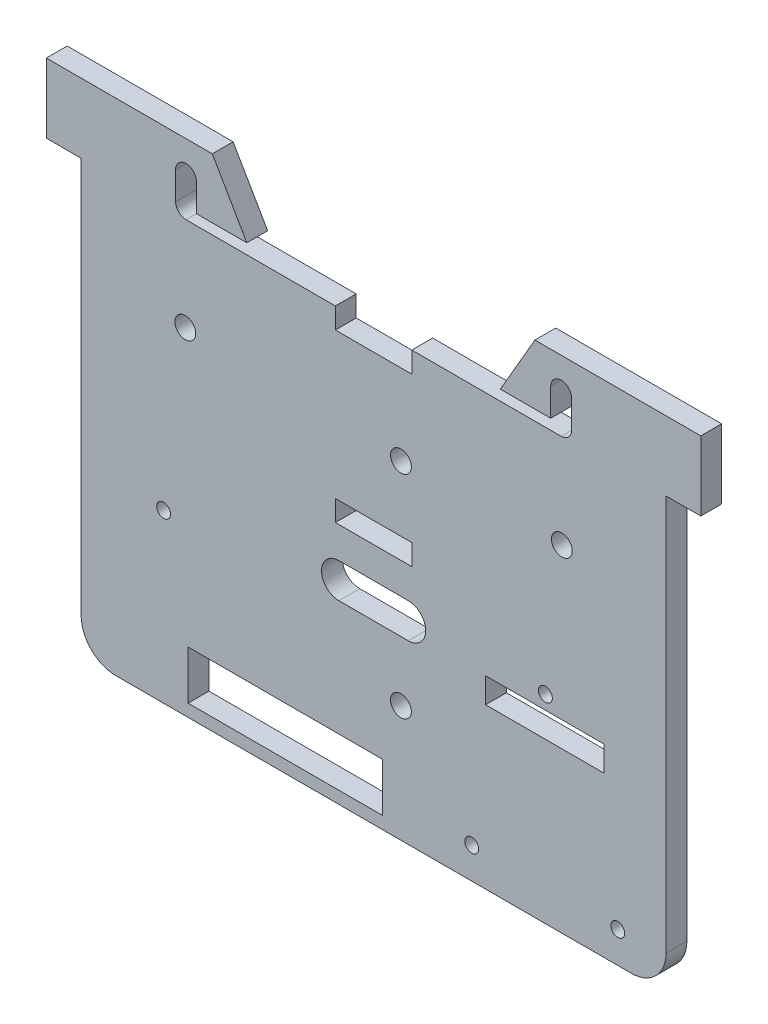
ISO-10303-21;
HEADER;
FILE_DESCRIPTION(('STEP AP214'),'2;1');
FILE_NAME('part.step','',(''),(''),'','','');
FILE_SCHEMA(('AUTOMOTIVE_DESIGN { 1 0 10303 214 1 1 1 1 }'));
ENDSEC;
DATA;
#1=APPLICATION_CONTEXT('core data for automotive mechanical design processes');
#2=APPLICATION_PROTOCOL_DEFINITION('international standard','automotive_design',2000,#1);
#3=PRODUCT_CONTEXT('',#1,'mechanical');
#4=PRODUCT('Part','Part','',(#3));
#5=PRODUCT_RELATED_PRODUCT_CATEGORY('part','',(#4));
#6=PRODUCT_DEFINITION_FORMATION('','',#4);
#7=PRODUCT_DEFINITION_CONTEXT('part definition',#1,'design');
#8=PRODUCT_DEFINITION('design','',#6,#7);
#9=PRODUCT_DEFINITION_SHAPE('','',#8);
#10=(LENGTH_UNIT() NAMED_UNIT(*) SI_UNIT(.MILLI.,.METRE.));
#11=(NAMED_UNIT(*) PLANE_ANGLE_UNIT() SI_UNIT($,.RADIAN.));
#12=(NAMED_UNIT(*) SI_UNIT($,.STERADIAN.) SOLID_ANGLE_UNIT());
#13=UNCERTAINTY_MEASURE_WITH_UNIT(LENGTH_MEASURE(1.E-05),#10,'distance_accuracy_value','');
#14=(GEOMETRIC_REPRESENTATION_CONTEXT(3) GLOBAL_UNCERTAINTY_ASSIGNED_CONTEXT((#13)) GLOBAL_UNIT_ASSIGNED_CONTEXT((#10,
#11,#12)) REPRESENTATION_CONTEXT('',''));
#15=CARTESIAN_POINT('',(0.,0.,0.));
#16=DIRECTION('',(0.,0.,1.));
#17=DIRECTION('',(1.,0.,0.));
#18=AXIS2_PLACEMENT_3D('',#15,#16,#17);
#19=CARTESIAN_POINT('',(0.,-27.1065477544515,3.));
#20=DIRECTION('',(0.,1.,0.));
#21=DIRECTION('',(-1.,0.,0.));
#22=AXIS2_PLACEMENT_3D('',#19,#20,#21);
#23=PLANE('',#22);
#24=DIRECTION('',(0.,0.,-1.));
#25=VECTOR('',#24,1.);
#26=CARTESIAN_POINT('',(52.6,-27.1065477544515,3.));
#27=LINE('',#26,#25);
#28=CARTESIAN_POINT('',(52.6,-27.1065477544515,3.));
#29=VERTEX_POINT('',#28);
#30=CARTESIAN_POINT('',(52.6,-27.1065477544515,0.));
#31=VERTEX_POINT('',#30);
#32=EDGE_CURVE('E492',#29,#31,#27,.T.);
#33=ORIENTED_EDGE('',*,*,#32,.F.);
#34=DIRECTION('',(1.,0.,0.));
#35=VECTOR('',#34,1.);
#36=CARTESIAN_POINT('',(0.,-27.1065477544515,3.));
#37=LINE('',#36,#35);
#38=CARTESIAN_POINT('',(74.1,-27.1065477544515,3.));
#39=VERTEX_POINT('',#38);
#40=EDGE_CURVE('E733',#29,#39,#37,.T.);
#41=ORIENTED_EDGE('',*,*,#40,.T.);
#42=DIRECTION('',(0.,0.,1.));
#43=VECTOR('',#42,1.);
#44=CARTESIAN_POINT('',(74.1,-27.1065477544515,-7.));
#45=LINE('',#44,#43);
#46=CARTESIAN_POINT('',(74.1,-27.1065477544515,0.));
#47=VERTEX_POINT('',#46);
#48=EDGE_CURVE('E568',#47,#39,#45,.T.);
#49=ORIENTED_EDGE('',*,*,#48,.F.);
#50=DIRECTION('',(1.,0.,0.));
#51=VECTOR('',#50,1.);
#52=CARTESIAN_POINT('',(0.,-27.1065477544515,0.));
#53=LINE('',#52,#51);
#54=EDGE_CURVE('E786',#31,#47,#53,.T.);
#55=ORIENTED_EDGE('',*,*,#54,.F.);
#56=EDGE_LOOP('',(#33,#41,#49,#55));
#57=FACE_BOUND('',#56,.T.);
#58=ADVANCED_FACE('F49',(#57),#23,.T.);
#59=CARTESIAN_POINT('',(10.5510029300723,6.0916243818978,3.));
#60=DIRECTION('',(0.866025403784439,0.5,0.));
#61=DIRECTION('',(-0.5,0.866025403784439,0.));
#62=AXIS2_PLACEMENT_3D('',#59,#60,#61);
#63=PLANE('',#62);
#64=DIRECTION('',(0.5,-0.866025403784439,0.));
#65=VECTOR('',#64,1.);
#66=CARTESIAN_POINT('',(10.5510029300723,6.0916243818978,3.));
#67=LINE('',#66,#65);
#68=CARTESIAN_POINT('',(23.8829584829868,-17.,3.));
#69=VERTEX_POINT('',#68);
#70=CARTESIAN_POINT('',(28.8519511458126,-25.6065477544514,3.));
#71=VERTEX_POINT('',#70);
#72=EDGE_CURVE('E686',#69,#71,#67,.T.);
#73=ORIENTED_EDGE('',*,*,#72,.T.);
#74=DIRECTION('',(0.,0.,1.));
#75=VECTOR('',#74,1.);
#76=CARTESIAN_POINT('',(28.8519511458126,-25.6065477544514,-7.));
#77=LINE('',#76,#75);
#78=CARTESIAN_POINT('',(28.8519511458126,-25.6065477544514,0.));
#79=VERTEX_POINT('',#78);
#80=EDGE_CURVE('E611',#79,#71,#77,.T.);
#81=ORIENTED_EDGE('',*,*,#80,.F.);
#82=DIRECTION('',(0.5,-0.866025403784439,0.));
#83=VECTOR('',#82,1.);
#84=CARTESIAN_POINT('',(10.5510029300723,6.0916243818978,0.));
#85=LINE('',#84,#83);
#86=CARTESIAN_POINT('',(23.8829584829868,-17.,0.));
#87=VERTEX_POINT('',#86);
#88=EDGE_CURVE('E674',#87,#79,#85,.T.);
#89=ORIENTED_EDGE('',*,*,#88,.F.);
#90=DIRECTION('',(0.,0.,-1.));
#91=VECTOR('',#90,1.);
#92=CARTESIAN_POINT('',(23.8829584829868,-17.,3.));
#93=LINE('',#92,#91);
#94=EDGE_CURVE('E826',#69,#87,#93,.T.);
#95=ORIENTED_EDGE('',*,*,#94,.F.);
#96=EDGE_LOOP('',(#73,#81,#89,#95));
#97=FACE_BOUND('',#96,.T.);
#98=ADVANCED_FACE('F51',(#97),#63,.T.);
#99=CARTESIAN_POINT('',(60.0989970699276,-34.6981721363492,3.));
#100=DIRECTION('',(-0.866025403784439,0.5,0.));
#101=DIRECTION('',(-0.5,-0.866025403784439,0.));
#102=AXIS2_PLACEMENT_3D('',#99,#100,#101);
#103=PLANE('',#102);
#104=DIRECTION('',(0.5,0.866025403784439,0.));
#105=VECTOR('',#104,1.);
#106=CARTESIAN_POINT('',(60.0989970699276,-34.6981721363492,0.));
#107=LINE('',#106,#105);
#108=CARTESIAN_POINT('',(65.3480488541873,-25.6065477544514,0.));
#109=VERTEX_POINT('',#108);
#110=CARTESIAN_POINT('',(70.3170415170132,-17.,0.));
#111=VERTEX_POINT('',#110);
#112=EDGE_CURVE('E783',#109,#111,#107,.T.);
#113=ORIENTED_EDGE('',*,*,#112,.F.);
#114=DIRECTION('',(0.,0.,1.));
#115=VECTOR('',#114,1.);
#116=CARTESIAN_POINT('',(65.3480488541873,-25.6065477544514,-7.));
#117=LINE('',#116,#115);
#118=CARTESIAN_POINT('',(65.3480488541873,-25.6065477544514,3.));
#119=VERTEX_POINT('',#118);
#120=EDGE_CURVE('E569',#109,#119,#117,.T.);
#121=ORIENTED_EDGE('',*,*,#120,.T.);
#122=DIRECTION('',(0.5,0.866025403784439,0.));
#123=VECTOR('',#122,1.);
#124=CARTESIAN_POINT('',(60.0989970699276,-34.6981721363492,3.));
#125=LINE('',#124,#123);
#126=CARTESIAN_POINT('',(70.3170415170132,-17.,3.));
#127=VERTEX_POINT('',#126);
#128=EDGE_CURVE('E730',#119,#127,#125,.T.);
#129=ORIENTED_EDGE('',*,*,#128,.T.);
#130=DIRECTION('',(0.,0.,-1.));
#131=VECTOR('',#130,1.);
#132=CARTESIAN_POINT('',(70.3170415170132,-17.,3.));
#133=LINE('',#132,#131);
#134=EDGE_CURVE('E738',#127,#111,#133,.T.);
#135=ORIENTED_EDGE('',*,*,#134,.T.);
#136=EDGE_LOOP('',(#113,#121,#129,#135));
#137=FACE_BOUND('',#136,.T.);
#138=ADVANCED_FACE('F888',(#137),#103,.T.);
#139=CARTESIAN_POINT('',(0.,0.,3.));
#140=DIRECTION('',(0.,0.,1.));
#141=DIRECTION('',(1.,0.,0.));
#142=AXIS2_PLACEMENT_3D('',#139,#140,#141);
#143=PLANE('',#142);
#144=CARTESIAN_POINT('',(51.0384927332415,-41.7232454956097,3.));
#145=DIRECTION('',(0.,0.,-1.));
#146=DIRECTION('',(-1.,0.,0.));
#147=AXIS2_PLACEMENT_3D('',#144,#145,#146);
#148=CIRCLE('',#147,1.5);
#149=CARTESIAN_POINT('',(49.5384927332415,-41.7232454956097,3.));
#150=VERTEX_POINT('',#149);
#151=EDGE_CURVE('E368',#150,#150,#148,.T.);
#152=ORIENTED_EDGE('',*,*,#151,.T.);
#153=EDGE_LOOP('',(#152));
#154=FACE_BOUND('',#153,.T.);
#155=DIRECTION('',(0.,-1.,0.));
#156=VECTOR('',#155,1.);
#157=CARTESIAN_POINT('',(63.2256055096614,-62.3933723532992,3.));
#158=LINE('',#157,#156);
#159=CARTESIAN_POINT('',(63.2256055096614,-62.3933723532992,3.));
#160=VERTEX_POINT('',#159);
#161=CARTESIAN_POINT('',(63.2256055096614,-66.0148359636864,3.));
#162=VERTEX_POINT('',#161);
#163=EDGE_CURVE('E65',#160,#162,#158,.T.);
#164=ORIENTED_EDGE('',*,*,#163,.F.);
#165=DIRECTION('',(-1.,0.,0.));
#166=VECTOR('',#165,1.);
#167=CARTESIAN_POINT('',(63.2256055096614,-62.3933723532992,3.));
#168=LINE('',#167,#166);
#169=CARTESIAN_POINT('',(80.2436055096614,-62.3933723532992,3.));
#170=VERTEX_POINT('',#169);
#171=EDGE_CURVE('E351',#170,#160,#168,.T.);
#172=ORIENTED_EDGE('',*,*,#171,.F.);
#173=DIRECTION('',(0.,1.,0.));
#174=VECTOR('',#173,1.);
#175=CARTESIAN_POINT('',(80.2436055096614,-62.3933723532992,3.));
#176=LINE('',#175,#174);
#177=CARTESIAN_POINT('',(80.2436055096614,-66.0148359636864,3.));
#178=VERTEX_POINT('',#177);
#179=EDGE_CURVE('E355',#178,#170,#176,.T.);
#180=ORIENTED_EDGE('',*,*,#179,.F.);
#181=DIRECTION('',(1.,0.,0.));
#182=VECTOR('',#181,1.);
#183=CARTESIAN_POINT('',(63.2256055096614,-66.0148359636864,3.));
#184=LINE('',#183,#182);
#185=EDGE_CURVE('E367',#162,#178,#184,.T.);
#186=ORIENTED_EDGE('',*,*,#185,.F.);
#187=EDGE_LOOP('',(#164,#172,#180,#186));
#188=FACE_BOUND('',#187,.T.);
#189=CARTESIAN_POINT('',(16.8769501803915,-64.9509005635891,3.));
#190=DIRECTION('',(0.,0.,1.));
#191=DIRECTION('',(1.,0.,0.));
#192=AXIS2_PLACEMENT_3D('',#189,#190,#191);
#193=CIRCLE('',#192,1.);
#194=CARTESIAN_POINT('',(17.8769501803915,-64.9509005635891,3.));
#195=VERTEX_POINT('',#194);
#196=EDGE_CURVE('E377',#195,#195,#193,.T.);
#197=ORIENTED_EDGE('',*,*,#196,.F.);
#198=EDGE_LOOP('',(#197));
#199=FACE_BOUND('',#198,.T.);
#200=CARTESIAN_POINT('',(71.8346055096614,-60.4022682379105,3.));
#201=DIRECTION('',(0.,0.,1.));
#202=DIRECTION('',(1.,0.,0.));
#203=AXIS2_PLACEMENT_3D('',#200,#201,#202);
#204=CIRCLE('',#203,1.);
#205=CARTESIAN_POINT('',(72.8346055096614,-60.4022682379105,3.));
#206=VERTEX_POINT('',#205);
#207=EDGE_CURVE('E406',#206,#206,#204,.T.);
#208=ORIENTED_EDGE('',*,*,#207,.F.);
#209=EDGE_LOOP('',(#208));
#210=FACE_BOUND('',#209,.T.);
#211=DIRECTION('',(0.,1.,0.));
#212=VECTOR('',#211,1.);
#213=CARTESIAN_POINT('',(48.3930152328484,-87.2284700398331,3.));
#214=LINE('',#213,#212);
#215=CARTESIAN_POINT('',(48.3930152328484,-87.2284700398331,3.));
#216=VERTEX_POINT('',#215);
#217=CARTESIAN_POINT('',(48.3930152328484,-80.2284700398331,3.));
#218=VERTEX_POINT('',#217);
#219=EDGE_CURVE('E387',#216,#218,#214,.T.);
#220=ORIENTED_EDGE('',*,*,#219,.F.);
#221=DIRECTION('',(1.,0.,0.));
#222=VECTOR('',#221,1.);
#223=CARTESIAN_POINT('',(20.3930152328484,-87.2284700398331,3.));
#224=LINE('',#223,#222);
#225=CARTESIAN_POINT('',(20.3930152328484,-87.2284700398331,3.));
#226=VERTEX_POINT('',#225);
#227=EDGE_CURVE('E416',#226,#216,#224,.T.);
#228=ORIENTED_EDGE('',*,*,#227,.F.);
#229=DIRECTION('',(0.,-1.,0.));
#230=VECTOR('',#229,1.);
#231=CARTESIAN_POINT('',(20.3930152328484,-87.2284700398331,3.));
#232=LINE('',#231,#230);
#233=CARTESIAN_POINT('',(20.3930152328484,-80.2284700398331,3.));
#234=VERTEX_POINT('',#233);
#235=EDGE_CURVE('E435',#234,#226,#232,.T.);
#236=ORIENTED_EDGE('',*,*,#235,.F.);
#237=DIRECTION('',(-1.,0.,0.));
#238=VECTOR('',#237,1.);
#239=CARTESIAN_POINT('',(20.3930152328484,-80.2284700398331,3.));
#240=LINE('',#239,#238);
#241=EDGE_CURVE('E431',#218,#234,#240,.T.);
#242=ORIENTED_EDGE('',*,*,#241,.F.);
#243=EDGE_LOOP('',(#220,#228,#236,#242));
#244=FACE_BOUND('',#243,.T.);
#245=CARTESIAN_POINT('',(82.2436055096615,-84.5083543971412,3.));
#246=DIRECTION('',(0.,0.,1.));
#247=DIRECTION('',(1.,0.,0.));
#248=AXIS2_PLACEMENT_3D('',#245,#246,#247);
#249=CIRCLE('',#248,1.00000000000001);
#250=CARTESIAN_POINT('',(83.2436055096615,-84.5083543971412,3.));
#251=VERTEX_POINT('',#250);
#252=EDGE_CURVE('E388',#251,#251,#249,.T.);
#253=ORIENTED_EDGE('',*,*,#252,.F.);
#254=EDGE_LOOP('',(#253));
#255=FACE_BOUND('',#254,.T.);
#256=CARTESIAN_POINT('',(51.0384927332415,-72.2232454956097,3.));
#257=DIRECTION('',(0.,0.,1.));
#258=DIRECTION('',(1.,0.,0.));
#259=AXIS2_PLACEMENT_3D('',#256,#257,#258);
#260=CIRCLE('',#259,1.5);
#261=CARTESIAN_POINT('',(52.5384927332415,-72.2232454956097,3.));
#262=VERTEX_POINT('',#261);
#263=EDGE_CURVE('E396',#262,#262,#260,.T.);
#264=ORIENTED_EDGE('',*,*,#263,.F.);
#265=EDGE_LOOP('',(#264));
#266=FACE_BOUND('',#265,.T.);
#267=CARTESIAN_POINT('',(61.2256055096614,-84.5083543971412,3.));
#268=DIRECTION('',(0.,0.,1.));
#269=DIRECTION('',(1.,0.,0.));
#270=AXIS2_PLACEMENT_3D('',#267,#268,#269);
#271=CIRCLE('',#270,1.);
#272=CARTESIAN_POINT('',(62.2256055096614,-84.5083543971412,3.));
#273=VERTEX_POINT('',#272);
#274=EDGE_CURVE('E405',#273,#273,#271,.T.);
#275=ORIENTED_EDGE('',*,*,#274,.F.);
#276=EDGE_LOOP('',(#275));
#277=FACE_BOUND('',#276,.T.);
#278=DIRECTION('',(1.,0.,0.));
#279=VECTOR('',#278,1.);
#280=CARTESIAN_POINT('',(0.,-89.,3.));
#281=LINE('',#280,#279);
#282=CARTESIAN_POINT('',(10.,-89.,3.));
#283=VERTEX_POINT('',#282);
#284=CARTESIAN_POINT('',(84.2,-89.,3.));
#285=VERTEX_POINT('',#284);
#286=EDGE_CURVE('E708',#283,#285,#281,.T.);
#287=ORIENTED_EDGE('',*,*,#286,.T.);
#288=CARTESIAN_POINT('',(84.2,-84.,3.));
#289=DIRECTION('',(0.,0.,1.));
#290=DIRECTION('',(1.,0.,0.));
#291=AXIS2_PLACEMENT_3D('',#288,#289,#290);
#292=CIRCLE('',#291,5.);
#293=CARTESIAN_POINT('',(89.2,-84.,3.));
#294=VERTEX_POINT('',#293);
#295=EDGE_CURVE('E711',#294,#285,#292,.F.);
#296=ORIENTED_EDGE('',*,*,#295,.F.);
#297=DIRECTION('',(0.,-1.,0.));
#298=VECTOR('',#297,1.);
#299=CARTESIAN_POINT('',(89.2,0.,3.));
#300=LINE('',#299,#298);
#301=CARTESIAN_POINT('',(89.2,-27.,3.));
#302=VERTEX_POINT('',#301);
#303=EDGE_CURVE('E715',#302,#294,#300,.T.);
#304=ORIENTED_EDGE('',*,*,#303,.F.);
#305=DIRECTION('',(1.,0.,0.));
#306=VECTOR('',#305,1.);
#307=CARTESIAN_POINT('',(0.,-27.,3.));
#308=LINE('',#307,#306);
#309=CARTESIAN_POINT('',(94.2,-27.,3.));
#310=VERTEX_POINT('',#309);
#311=EDGE_CURVE('E719',#302,#310,#308,.T.);
#312=ORIENTED_EDGE('',*,*,#311,.T.);
#313=DIRECTION('',(0.,-1.,0.));
#314=VECTOR('',#313,1.);
#315=CARTESIAN_POINT('',(94.2,-1.30728761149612E-13,3.));
#316=LINE('',#315,#314);
#317=CARTESIAN_POINT('',(94.2,-17.,3.));
#318=VERTEX_POINT('',#317);
#319=EDGE_CURVE('E722',#318,#310,#316,.T.);
#320=ORIENTED_EDGE('',*,*,#319,.F.);
#321=DIRECTION('',(1.,0.,0.));
#322=VECTOR('',#321,1.);
#323=CARTESIAN_POINT('',(0.,-17.,3.));
#324=LINE('',#323,#322);
#325=EDGE_CURVE('E726',#127,#318,#324,.T.);
#326=ORIENTED_EDGE('',*,*,#325,.F.);
#327=ORIENTED_EDGE('',*,*,#128,.F.);
#328=DIRECTION('',(1.,0.,0.));
#329=VECTOR('',#328,1.);
#330=CARTESIAN_POINT('',(0.,-25.6065477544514,3.));
#331=LINE('',#330,#329);
#332=CARTESIAN_POINT('',(72.6,-25.6065477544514,3.));
#333=VERTEX_POINT('',#332);
#334=EDGE_CURVE('E564',#119,#333,#331,.T.);
#335=ORIENTED_EDGE('',*,*,#334,.T.);
#336=DIRECTION('',(0.,1.,0.));
#337=VECTOR('',#336,1.);
#338=CARTESIAN_POINT('',(72.6,0.,3.));
#339=LINE('',#338,#337);
#340=CARTESIAN_POINT('',(72.6,-21.6065477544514,3.));
#341=VERTEX_POINT('',#340);
#342=EDGE_CURVE('E560',#333,#341,#339,.T.);
#343=ORIENTED_EDGE('',*,*,#342,.T.);
#344=CARTESIAN_POINT('',(74.1,-21.6065477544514,3.));
#345=DIRECTION('',(0.,0.,1.));
#346=DIRECTION('',(1.,0.,0.));
#347=AXIS2_PLACEMENT_3D('',#344,#345,#346);
#348=CIRCLE('',#347,1.5);
#349=CARTESIAN_POINT('',(75.6,-21.6065477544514,3.));
#350=VERTEX_POINT('',#349);
#351=EDGE_CURVE('E556',#341,#350,#348,.F.);
#352=ORIENTED_EDGE('',*,*,#351,.T.);
#353=DIRECTION('',(0.,1.,0.));
#354=VECTOR('',#353,1.);
#355=CARTESIAN_POINT('',(75.6,0.,3.));
#356=LINE('',#355,#354);
#357=CARTESIAN_POINT('',(75.6,-25.6065477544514,3.));
#358=VERTEX_POINT('',#357);
#359=EDGE_CURVE('E551',#358,#350,#356,.T.);
#360=ORIENTED_EDGE('',*,*,#359,.F.);
#361=CARTESIAN_POINT('',(74.1,-25.6065477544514,3.));
#362=DIRECTION('',(0.,0.,1.));
#363=DIRECTION('',(1.,0.,0.));
#364=AXIS2_PLACEMENT_3D('',#361,#362,#363);
#365=CIRCLE('',#364,1.5);
#366=EDGE_CURVE('E547',#358,#39,#365,.F.);
#367=ORIENTED_EDGE('',*,*,#366,.T.);
#368=ORIENTED_EDGE('',*,*,#40,.F.);
#369=DIRECTION('',(0.,-1.,0.));
#370=VECTOR('',#369,1.);
#371=CARTESIAN_POINT('',(52.6,-27.1065477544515,3.));
#372=LINE('',#371,#370);
#373=CARTESIAN_POINT('',(52.6,-30.1065477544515,3.));
#374=VERTEX_POINT('',#373);
#375=EDGE_CURVE('E467',#29,#374,#372,.T.);
#376=ORIENTED_EDGE('',*,*,#375,.T.);
#377=DIRECTION('',(-1.,0.,0.));
#378=VECTOR('',#377,1.);
#379=CARTESIAN_POINT('',(41.6,-30.1065477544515,3.));
#380=LINE('',#379,#378);
#381=CARTESIAN_POINT('',(41.6,-30.1065477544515,3.));
#382=VERTEX_POINT('',#381);
#383=EDGE_CURVE('E471',#374,#382,#380,.T.);
#384=ORIENTED_EDGE('',*,*,#383,.T.);
#385=DIRECTION('',(0.,1.,0.));
#386=VECTOR('',#385,1.);
#387=CARTESIAN_POINT('',(41.6,-27.1065477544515,3.));
#388=LINE('',#387,#386);
#389=CARTESIAN_POINT('',(41.6,-27.1065477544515,3.));
#390=VERTEX_POINT('',#389);
#391=EDGE_CURVE('E476',#382,#390,#388,.T.);
#392=ORIENTED_EDGE('',*,*,#391,.T.);
#393=CARTESIAN_POINT('',(20.1,-27.1065477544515,3.));
#394=VERTEX_POINT('',#393);
#395=EDGE_CURVE('E734',#394,#390,#37,.T.);
#396=ORIENTED_EDGE('',*,*,#395,.F.);
#397=CARTESIAN_POINT('',(20.1,-25.6065477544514,3.));
#398=DIRECTION('',(0.,0.,1.));
#399=DIRECTION('',(1.,0.,0.));
#400=AXIS2_PLACEMENT_3D('',#397,#398,#399);
#401=CIRCLE('',#400,1.5);
#402=CARTESIAN_POINT('',(18.6,-25.6065477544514,3.));
#403=VERTEX_POINT('',#402);
#404=EDGE_CURVE('E600',#403,#394,#401,.T.);
#405=ORIENTED_EDGE('',*,*,#404,.F.);
#406=DIRECTION('',(0.,1.,0.));
#407=VECTOR('',#406,1.);
#408=CARTESIAN_POINT('',(18.6,0.,3.));
#409=LINE('',#408,#407);
#410=CARTESIAN_POINT('',(18.6,-21.6065477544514,3.));
#411=VERTEX_POINT('',#410);
#412=EDGE_CURVE('E596',#403,#411,#409,.T.);
#413=ORIENTED_EDGE('',*,*,#412,.T.);
#414=CARTESIAN_POINT('',(20.1,-21.6065477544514,3.));
#415=DIRECTION('',(0.,0.,1.));
#416=DIRECTION('',(1.,0.,0.));
#417=AXIS2_PLACEMENT_3D('',#414,#415,#416);
#418=CIRCLE('',#417,1.5);
#419=CARTESIAN_POINT('',(21.6,-21.6065477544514,3.));
#420=VERTEX_POINT('',#419);
#421=EDGE_CURVE('E592',#420,#411,#418,.T.);
#422=ORIENTED_EDGE('',*,*,#421,.F.);
#423=DIRECTION('',(0.,1.,0.));
#424=VECTOR('',#423,1.);
#425=CARTESIAN_POINT('',(21.6,0.,3.));
#426=LINE('',#425,#424);
#427=CARTESIAN_POINT('',(21.6,-25.6065477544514,3.));
#428=VERTEX_POINT('',#427);
#429=EDGE_CURVE('E495',#428,#420,#426,.T.);
#430=ORIENTED_EDGE('',*,*,#429,.F.);
#431=DIRECTION('',(1.,0.,0.));
#432=VECTOR('',#431,1.);
#433=CARTESIAN_POINT('',(0.,-25.6065477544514,3.));
#434=LINE('',#433,#432);
#435=EDGE_CURVE('E604',#428,#71,#434,.T.);
#436=ORIENTED_EDGE('',*,*,#435,.T.);
#437=ORIENTED_EDGE('',*,*,#72,.F.);
#438=DIRECTION('',(1.,0.,0.));
#439=VECTOR('',#438,1.);
#440=CARTESIAN_POINT('',(0.,-17.,3.));
#441=LINE('',#440,#439);
#442=CARTESIAN_POINT('',(0.,-17.,3.));
#443=VERTEX_POINT('',#442);
#444=EDGE_CURVE('E690',#443,#69,#441,.T.);
#445=ORIENTED_EDGE('',*,*,#444,.F.);
#446=DIRECTION('',(0.,-1.,0.));
#447=VECTOR('',#446,1.);
#448=CARTESIAN_POINT('',(0.,0.,3.));
#449=LINE('',#448,#447);
#450=CARTESIAN_POINT('',(0.,-27.,3.));
#451=VERTEX_POINT('',#450);
#452=EDGE_CURVE('E695',#443,#451,#449,.T.);
#453=ORIENTED_EDGE('',*,*,#452,.T.);
#454=DIRECTION('',(1.,0.,0.));
#455=VECTOR('',#454,1.);
#456=CARTESIAN_POINT('',(0.,-27.,3.));
#457=LINE('',#456,#455);
#458=CARTESIAN_POINT('',(5.,-27.,3.));
#459=VERTEX_POINT('',#458);
#460=EDGE_CURVE('E698',#451,#459,#457,.T.);
#461=ORIENTED_EDGE('',*,*,#460,.T.);
#462=DIRECTION('',(0.,-1.,0.));
#463=VECTOR('',#462,1.);
#464=CARTESIAN_POINT('',(5.,0.,3.));
#465=LINE('',#464,#463);
#466=CARTESIAN_POINT('',(5.,-84.,3.));
#467=VERTEX_POINT('',#466);
#468=EDGE_CURVE('E701',#459,#467,#465,.T.);
#469=ORIENTED_EDGE('',*,*,#468,.T.);
#470=CARTESIAN_POINT('',(10.,-84.,3.));
#471=DIRECTION('',(0.,0.,1.));
#472=DIRECTION('',(1.,0.,0.));
#473=AXIS2_PLACEMENT_3D('',#470,#471,#472);
#474=CIRCLE('',#473,5.);
#475=EDGE_CURVE('E704',#283,#467,#474,.F.);
#476=ORIENTED_EDGE('',*,*,#475,.F.);
#477=EDGE_LOOP('',(#287,#296,#304,#312,#320,#326,#327,#335,#343,#352,#360,#367,#368,#376,#384,
#392,#396,#405,#413,#422,#430,#436,#437,#445,#453,#461,#469,#476));
#478=FACE_BOUND('',#477,.T.);
#479=DIRECTION('',(0.,1.,0.));
#480=VECTOR('',#479,1.);
#481=CARTESIAN_POINT('',(41.6,-51.1065477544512,3.));
#482=LINE('',#481,#480);
#483=CARTESIAN_POINT('',(41.6,-54.1065477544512,3.));
#484=VERTEX_POINT('',#483);
#485=CARTESIAN_POINT('',(41.6,-51.1065477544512,3.));
#486=VERTEX_POINT('',#485);
#487=EDGE_CURVE('E505',#484,#486,#482,.T.);
#488=ORIENTED_EDGE('',*,*,#487,.T.);
#489=DIRECTION('',(1.,0.,0.));
#490=VECTOR('',#489,1.);
#491=CARTESIAN_POINT('',(52.6,-51.1065477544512,3.));
#492=LINE('',#491,#490);
#493=CARTESIAN_POINT('',(52.6,-51.1065477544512,3.));
#494=VERTEX_POINT('',#493);
#495=EDGE_CURVE('E509',#486,#494,#492,.T.);
#496=ORIENTED_EDGE('',*,*,#495,.T.);
#497=DIRECTION('',(0.,-1.,0.));
#498=VECTOR('',#497,1.);
#499=CARTESIAN_POINT('',(52.6,-51.1065477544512,3.));
#500=LINE('',#499,#498);
#501=CARTESIAN_POINT('',(52.6,-54.1065477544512,3.));
#502=VERTEX_POINT('',#501);
#503=EDGE_CURVE('E514',#494,#502,#500,.T.);
#504=ORIENTED_EDGE('',*,*,#503,.T.);
#505=DIRECTION('',(-1.,0.,0.));
#506=VECTOR('',#505,1.);
#507=CARTESIAN_POINT('',(52.6,-54.1065477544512,3.));
#508=LINE('',#507,#506);
#509=EDGE_CURVE('E518',#502,#484,#508,.T.);
#510=ORIENTED_EDGE('',*,*,#509,.T.);
#511=EDGE_LOOP('',(#488,#496,#504,#510));
#512=FACE_BOUND('',#511,.T.);
#513=CARTESIAN_POINT('',(42.1,-61.1,3.));
#514=DIRECTION('',(0.,0.,-1.));
#515=DIRECTION('',(-1.,0.,0.));
#516=AXIS2_PLACEMENT_3D('',#513,#514,#515);
#517=CIRCLE('',#516,2.5);
#518=CARTESIAN_POINT('',(42.1,-63.6,3.));
#519=VERTEX_POINT('',#518);
#520=CARTESIAN_POINT('',(42.1,-58.6,3.));
#521=VERTEX_POINT('',#520);
#522=EDGE_CURVE('E626',#519,#521,#517,.T.);
#523=ORIENTED_EDGE('',*,*,#522,.T.);
#524=DIRECTION('',(1.,0.,0.));
#525=VECTOR('',#524,1.);
#526=CARTESIAN_POINT('',(42.1,-58.6,3.));
#527=LINE('',#526,#525);
#528=CARTESIAN_POINT('',(52.1,-58.6,3.));
#529=VERTEX_POINT('',#528);
#530=EDGE_CURVE('E630',#521,#529,#527,.T.);
#531=ORIENTED_EDGE('',*,*,#530,.T.);
#532=CARTESIAN_POINT('',(52.1,-61.1,3.));
#533=DIRECTION('',(0.,0.,-1.));
#534=DIRECTION('',(-1.,0.,0.));
#535=AXIS2_PLACEMENT_3D('',#532,#533,#534);
#536=CIRCLE('',#535,2.5);
#537=CARTESIAN_POINT('',(52.1,-63.6,3.));
#538=VERTEX_POINT('',#537);
#539=EDGE_CURVE('E635',#529,#538,#536,.T.);
#540=ORIENTED_EDGE('',*,*,#539,.T.);
#541=DIRECTION('',(-1.,0.,0.));
#542=VECTOR('',#541,1.);
#543=CARTESIAN_POINT('',(42.1,-63.6,3.));
#544=LINE('',#543,#542);
#545=EDGE_CURVE('E639',#538,#519,#544,.T.);
#546=ORIENTED_EDGE('',*,*,#545,.T.);
#547=EDGE_LOOP('',(#523,#531,#540,#546));
#548=FACE_BOUND('',#547,.T.);
#549=CARTESIAN_POINT('',(74.2,-40.6065477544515,3.));
#550=DIRECTION('',(0.,0.,-1.));
#551=DIRECTION('',(-1.,0.,0.));
#552=AXIS2_PLACEMENT_3D('',#549,#550,#551);
#553=CIRCLE('',#552,1.5);
#554=CARTESIAN_POINT('',(72.7,-40.6065477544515,3.));
#555=VERTEX_POINT('',#554);
#556=EDGE_CURVE('E670',#555,#555,#553,.T.);
#557=ORIENTED_EDGE('',*,*,#556,.T.);
#558=EDGE_LOOP('',(#557));
#559=FACE_BOUND('',#558,.T.);
#560=CARTESIAN_POINT('',(20.,-40.6065477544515,3.));
#561=DIRECTION('',(0.,0.,-1.));
#562=DIRECTION('',(-1.,0.,0.));
#563=AXIS2_PLACEMENT_3D('',#560,#561,#562);
#564=CIRCLE('',#563,1.5);
#565=CARTESIAN_POINT('',(18.5,-40.6065477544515,3.));
#566=VERTEX_POINT('',#565);
#567=EDGE_CURVE('E679',#566,#566,#564,.T.);
#568=ORIENTED_EDGE('',*,*,#567,.T.);
#569=EDGE_LOOP('',(#568));
#570=FACE_BOUND('',#569,.T.);
#571=ADVANCED_FACE('F880',(#154,#188,#199,#210,#244,#255,#266,#277,#478,#512,#548,#559,#570),
#143,.T.);
#572=CARTESIAN_POINT('',(0.,0.,0.));
#573=DIRECTION('',(0.,0.,1.));
#574=DIRECTION('',(1.,0.,0.));
#575=AXIS2_PLACEMENT_3D('',#572,#573,#574);
#576=PLANE('',#575);
#577=CARTESIAN_POINT('',(51.0384927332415,-41.7232454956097,0.));
#578=DIRECTION('',(0.,0.,-1.));
#579=DIRECTION('',(-1.,0.,0.));
#580=AXIS2_PLACEMENT_3D('',#577,#578,#579);
#581=CIRCLE('',#580,1.5);
#582=CARTESIAN_POINT('',(49.5384927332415,-41.7232454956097,0.));
#583=VERTEX_POINT('',#582);
#584=EDGE_CURVE('E358',#583,#583,#581,.T.);
#585=ORIENTED_EDGE('',*,*,#584,.F.);
#586=EDGE_LOOP('',(#585));
#587=FACE_BOUND('',#586,.T.);
#588=DIRECTION('',(-1.,0.,0.));
#589=VECTOR('',#588,1.);
#590=CARTESIAN_POINT('',(63.2256055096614,-62.3933723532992,0.));
#591=LINE('',#590,#589);
#592=CARTESIAN_POINT('',(80.2436055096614,-62.3933723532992,0.));
#593=VERTEX_POINT('',#592);
#594=CARTESIAN_POINT('',(63.2256055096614,-62.3933723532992,0.));
#595=VERTEX_POINT('',#594);
#596=EDGE_CURVE('E339',#593,#595,#591,.T.);
#597=ORIENTED_EDGE('',*,*,#596,.T.);
#598=DIRECTION('',(0.,-1.,0.));
#599=VECTOR('',#598,1.);
#600=CARTESIAN_POINT('',(63.2256055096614,-62.3933723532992,0.));
#601=LINE('',#600,#599);
#602=CARTESIAN_POINT('',(63.2256055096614,-66.0148359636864,0.));
#603=VERTEX_POINT('',#602);
#604=EDGE_CURVE('E332',#595,#603,#601,.T.);
#605=ORIENTED_EDGE('',*,*,#604,.T.);
#606=DIRECTION('',(1.,0.,0.));
#607=VECTOR('',#606,1.);
#608=CARTESIAN_POINT('',(63.2256055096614,-66.0148359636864,0.));
#609=LINE('',#608,#607);
#610=CARTESIAN_POINT('',(80.2436055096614,-66.0148359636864,0.));
#611=VERTEX_POINT('',#610);
#612=EDGE_CURVE('E342',#603,#611,#609,.T.);
#613=ORIENTED_EDGE('',*,*,#612,.T.);
#614=DIRECTION('',(0.,1.,0.));
#615=VECTOR('',#614,1.);
#616=CARTESIAN_POINT('',(80.2436055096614,-62.3933723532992,0.));
#617=LINE('',#616,#615);
#618=EDGE_CURVE('E73',#611,#593,#617,.T.);
#619=ORIENTED_EDGE('',*,*,#618,.T.);
#620=EDGE_LOOP('',(#597,#605,#613,#619));
#621=FACE_BOUND('',#620,.T.);
#622=CARTESIAN_POINT('',(16.8769501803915,-64.9509005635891,0.));
#623=DIRECTION('',(0.,0.,1.));
#624=DIRECTION('',(1.,0.,0.));
#625=AXIS2_PLACEMENT_3D('',#622,#623,#624);
#626=CIRCLE('',#625,1.);
#627=CARTESIAN_POINT('',(17.8769501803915,-64.9509005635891,0.));
#628=VERTEX_POINT('',#627);
#629=EDGE_CURVE('E400',#628,#628,#626,.T.);
#630=ORIENTED_EDGE('',*,*,#629,.T.);
#631=EDGE_LOOP('',(#630));
#632=FACE_BOUND('',#631,.T.);
#633=CARTESIAN_POINT('',(71.8346055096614,-60.4022682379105,0.));
#634=DIRECTION('',(0.,0.,1.));
#635=DIRECTION('',(1.,0.,0.));
#636=AXIS2_PLACEMENT_3D('',#633,#634,#635);
#637=CIRCLE('',#636,1.);
#638=CARTESIAN_POINT('',(72.8346055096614,-60.4022682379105,0.));
#639=VERTEX_POINT('',#638);
#640=EDGE_CURVE('E401',#639,#639,#637,.T.);
#641=ORIENTED_EDGE('',*,*,#640,.T.);
#642=EDGE_LOOP('',(#641));
#643=FACE_BOUND('',#642,.T.);
#644=DIRECTION('',(1.,0.,0.));
#645=VECTOR('',#644,1.);
#646=CARTESIAN_POINT('',(20.3930152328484,-87.2284700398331,0.));
#647=LINE('',#646,#645);
#648=CARTESIAN_POINT('',(20.3930152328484,-87.2284700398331,0.));
#649=VERTEX_POINT('',#648);
#650=CARTESIAN_POINT('',(48.3930152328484,-87.2284700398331,0.));
#651=VERTEX_POINT('',#650);
#652=EDGE_CURVE('E424',#649,#651,#647,.T.);
#653=ORIENTED_EDGE('',*,*,#652,.T.);
#654=DIRECTION('',(0.,1.,0.));
#655=VECTOR('',#654,1.);
#656=CARTESIAN_POINT('',(48.3930152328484,-87.2284700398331,0.));
#657=LINE('',#656,#655);
#658=CARTESIAN_POINT('',(48.3930152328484,-80.2284700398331,0.));
#659=VERTEX_POINT('',#658);
#660=EDGE_CURVE('E411',#651,#659,#657,.T.);
#661=ORIENTED_EDGE('',*,*,#660,.T.);
#662=DIRECTION('',(-1.,0.,0.));
#663=VECTOR('',#662,1.);
#664=CARTESIAN_POINT('',(20.3930152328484,-80.2284700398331,0.));
#665=LINE('',#664,#663);
#666=CARTESIAN_POINT('',(20.3930152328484,-80.2284700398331,0.));
#667=VERTEX_POINT('',#666);
#668=EDGE_CURVE('E415',#659,#667,#665,.T.);
#669=ORIENTED_EDGE('',*,*,#668,.T.);
#670=DIRECTION('',(0.,-1.,0.));
#671=VECTOR('',#670,1.);
#672=CARTESIAN_POINT('',(20.3930152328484,-87.2284700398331,0.));
#673=LINE('',#672,#671);
#674=EDGE_CURVE('E420',#667,#649,#673,.T.);
#675=ORIENTED_EDGE('',*,*,#674,.T.);
#676=EDGE_LOOP('',(#653,#661,#669,#675));
#677=FACE_BOUND('',#676,.T.);
#678=CARTESIAN_POINT('',(82.2436055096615,-84.5083543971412,0.));
#679=DIRECTION('',(0.,0.,1.));
#680=DIRECTION('',(1.,0.,0.));
#681=AXIS2_PLACEMENT_3D('',#678,#679,#680);
#682=CIRCLE('',#681,1.00000000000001);
#683=CARTESIAN_POINT('',(83.2436055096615,-84.5083543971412,0.));
#684=VERTEX_POINT('',#683);
#685=EDGE_CURVE('E383',#684,#684,#682,.T.);
#686=ORIENTED_EDGE('',*,*,#685,.T.);
#687=EDGE_LOOP('',(#686));
#688=FACE_BOUND('',#687,.T.);
#689=CARTESIAN_POINT('',(51.0384927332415,-72.2232454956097,0.));
#690=DIRECTION('',(0.,0.,1.));
#691=DIRECTION('',(1.,0.,0.));
#692=AXIS2_PLACEMENT_3D('',#689,#690,#691);
#693=CIRCLE('',#692,1.5);
#694=CARTESIAN_POINT('',(52.5384927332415,-72.2232454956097,0.));
#695=VERTEX_POINT('',#694);
#696=EDGE_CURVE('E392',#695,#695,#693,.T.);
#697=ORIENTED_EDGE('',*,*,#696,.T.);
#698=EDGE_LOOP('',(#697));
#699=FACE_BOUND('',#698,.T.);
#700=CARTESIAN_POINT('',(61.2256055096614,-84.5083543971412,0.));
#701=DIRECTION('',(0.,0.,1.));
#702=DIRECTION('',(1.,0.,0.));
#703=AXIS2_PLACEMENT_3D('',#700,#701,#702);
#704=CIRCLE('',#703,1.);
#705=CARTESIAN_POINT('',(62.2256055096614,-84.5083543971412,0.));
#706=VERTEX_POINT('',#705);
#707=EDGE_CURVE('E459',#706,#706,#704,.T.);
#708=ORIENTED_EDGE('',*,*,#707,.T.);
#709=EDGE_LOOP('',(#708));
#710=FACE_BOUND('',#709,.T.);
#711=CARTESIAN_POINT('',(84.2,-84.,0.));
#712=DIRECTION('',(0.,0.,1.));
#713=DIRECTION('',(1.,0.,0.));
#714=AXIS2_PLACEMENT_3D('',#711,#712,#713);
#715=CIRCLE('',#714,5.);
#716=CARTESIAN_POINT('',(89.2,-84.,0.));
#717=VERTEX_POINT('',#716);
#718=CARTESIAN_POINT('',(84.2,-89.,0.));
#719=VERTEX_POINT('',#718);
#720=EDGE_CURVE('E763',#717,#719,#715,.F.);
#721=ORIENTED_EDGE('',*,*,#720,.T.);
#722=DIRECTION('',(1.,0.,0.));
#723=VECTOR('',#722,1.);
#724=CARTESIAN_POINT('',(0.,-89.,0.));
#725=LINE('',#724,#723);
#726=CARTESIAN_POINT('',(10.,-89.,0.));
#727=VERTEX_POINT('',#726);
#728=EDGE_CURVE('E760',#727,#719,#725,.T.);
#729=ORIENTED_EDGE('',*,*,#728,.F.);
#730=CARTESIAN_POINT('',(10.,-84.,0.));
#731=DIRECTION('',(0.,0.,1.));
#732=DIRECTION('',(1.,0.,0.));
#733=AXIS2_PLACEMENT_3D('',#730,#731,#732);
#734=CIRCLE('',#733,5.);
#735=CARTESIAN_POINT('',(5.,-84.,0.));
#736=VERTEX_POINT('',#735);
#737=EDGE_CURVE('E756',#727,#736,#734,.F.);
#738=ORIENTED_EDGE('',*,*,#737,.T.);
#739=DIRECTION('',(0.,-1.,0.));
#740=VECTOR('',#739,1.);
#741=CARTESIAN_POINT('',(5.,0.,0.));
#742=LINE('',#741,#740);
#743=CARTESIAN_POINT('',(5.,-27.,0.));
#744=VERTEX_POINT('',#743);
#745=EDGE_CURVE('E752',#744,#736,#742,.T.);
#746=ORIENTED_EDGE('',*,*,#745,.F.);
#747=DIRECTION('',(1.,0.,0.));
#748=VECTOR('',#747,1.);
#749=CARTESIAN_POINT('',(0.,-27.,0.));
#750=LINE('',#749,#748);
#751=CARTESIAN_POINT('',(0.,-27.,0.));
#752=VERTEX_POINT('',#751);
#753=EDGE_CURVE('E749',#752,#744,#750,.T.);
#754=ORIENTED_EDGE('',*,*,#753,.F.);
#755=DIRECTION('',(0.,-1.,0.));
#756=VECTOR('',#755,1.);
#757=CARTESIAN_POINT('',(0.,0.,0.));
#758=LINE('',#757,#756);
#759=CARTESIAN_POINT('',(0.,-17.,0.));
#760=VERTEX_POINT('',#759);
#761=EDGE_CURVE('E746',#760,#752,#758,.T.);
#762=ORIENTED_EDGE('',*,*,#761,.F.);
#763=DIRECTION('',(1.,0.,0.));
#764=VECTOR('',#763,1.);
#765=CARTESIAN_POINT('',(0.,-17.,0.));
#766=LINE('',#765,#764);
#767=EDGE_CURVE('E742',#760,#87,#766,.T.);
#768=ORIENTED_EDGE('',*,*,#767,.T.);
#769=ORIENTED_EDGE('',*,*,#88,.T.);
#770=DIRECTION('',(1.,0.,0.));
#771=VECTOR('',#770,1.);
#772=CARTESIAN_POINT('',(0.,-25.6065477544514,0.));
#773=LINE('',#772,#771);
#774=CARTESIAN_POINT('',(21.6,-25.6065477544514,0.));
#775=VERTEX_POINT('',#774);
#776=EDGE_CURVE('E845',#775,#79,#773,.T.);
#777=ORIENTED_EDGE('',*,*,#776,.F.);
#778=DIRECTION('',(0.,1.,0.));
#779=VECTOR('',#778,1.);
#780=CARTESIAN_POINT('',(21.6,0.,0.));
#781=LINE('',#780,#779);
#782=CARTESIAN_POINT('',(21.6,-21.6065477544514,0.));
#783=VERTEX_POINT('',#782);
#784=EDGE_CURVE('E841',#775,#783,#781,.T.);
#785=ORIENTED_EDGE('',*,*,#784,.T.);
#786=CARTESIAN_POINT('',(20.1,-21.6065477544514,0.));
#787=DIRECTION('',(0.,0.,1.));
#788=DIRECTION('',(1.,0.,0.));
#789=AXIS2_PLACEMENT_3D('',#786,#787,#788);
#790=CIRCLE('',#789,1.5);
#791=CARTESIAN_POINT('',(18.6,-21.6065477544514,0.));
#792=VERTEX_POINT('',#791);
#793=EDGE_CURVE('E829',#783,#792,#790,.T.);
#794=ORIENTED_EDGE('',*,*,#793,.T.);
#795=DIRECTION('',(0.,1.,0.));
#796=VECTOR('',#795,1.);
#797=CARTESIAN_POINT('',(18.6,0.,0.));
#798=LINE('',#797,#796);
#799=CARTESIAN_POINT('',(18.6,-25.6065477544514,0.));
#800=VERTEX_POINT('',#799);
#801=EDGE_CURVE('E833',#800,#792,#798,.T.);
#802=ORIENTED_EDGE('',*,*,#801,.F.);
#803=CARTESIAN_POINT('',(20.1,-25.6065477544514,0.));
#804=DIRECTION('',(0.,0.,1.));
#805=DIRECTION('',(1.,0.,0.));
#806=AXIS2_PLACEMENT_3D('',#803,#804,#805);
#807=CIRCLE('',#806,1.5);
#808=CARTESIAN_POINT('',(20.1,-27.1065477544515,0.));
#809=VERTEX_POINT('',#808);
#810=EDGE_CURVE('E837',#800,#809,#807,.T.);
#811=ORIENTED_EDGE('',*,*,#810,.T.);
#812=CARTESIAN_POINT('',(41.6,-27.1065477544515,0.));
#813=VERTEX_POINT('',#812);
#814=EDGE_CURVE('E691',#809,#813,#53,.T.);
#815=ORIENTED_EDGE('',*,*,#814,.T.);
#816=DIRECTION('',(0.,1.,0.));
#817=VECTOR('',#816,1.);
#818=CARTESIAN_POINT('',(41.6,-27.1065477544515,0.));
#819=LINE('',#818,#817);
#820=CARTESIAN_POINT('',(41.6,-30.1065477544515,0.));
#821=VERTEX_POINT('',#820);
#822=EDGE_CURVE('E472',#821,#813,#819,.T.);
#823=ORIENTED_EDGE('',*,*,#822,.F.);
#824=DIRECTION('',(-1.,0.,0.));
#825=VECTOR('',#824,1.);
#826=CARTESIAN_POINT('',(41.6,-30.1065477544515,0.));
#827=LINE('',#826,#825);
#828=CARTESIAN_POINT('',(52.6,-30.1065477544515,0.));
#829=VERTEX_POINT('',#828);
#830=EDGE_CURVE('E485',#829,#821,#827,.T.);
#831=ORIENTED_EDGE('',*,*,#830,.F.);
#832=DIRECTION('',(0.,-1.,0.));
#833=VECTOR('',#832,1.);
#834=CARTESIAN_POINT('',(52.6,-27.1065477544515,0.));
#835=LINE('',#834,#833);
#836=EDGE_CURVE('E481',#31,#829,#835,.T.);
#837=ORIENTED_EDGE('',*,*,#836,.F.);
#838=ORIENTED_EDGE('',*,*,#54,.T.);
#839=CARTESIAN_POINT('',(74.1,-25.6065477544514,0.));
#840=DIRECTION('',(0.,0.,1.));
#841=DIRECTION('',(1.,0.,0.));
#842=AXIS2_PLACEMENT_3D('',#839,#840,#841);
#843=CIRCLE('',#842,1.5);
#844=CARTESIAN_POINT('',(75.6,-25.6065477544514,0.));
#845=VERTEX_POINT('',#844);
#846=EDGE_CURVE('E848',#845,#47,#843,.F.);
#847=ORIENTED_EDGE('',*,*,#846,.F.);
#848=DIRECTION('',(0.,1.,0.));
#849=VECTOR('',#848,1.);
#850=CARTESIAN_POINT('',(75.6,0.,0.));
#851=LINE('',#850,#849);
#852=CARTESIAN_POINT('',(75.6,-21.6065477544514,0.));
#853=VERTEX_POINT('',#852);
#854=EDGE_CURVE('E852',#845,#853,#851,.T.);
#855=ORIENTED_EDGE('',*,*,#854,.T.);
#856=CARTESIAN_POINT('',(74.1,-21.6065477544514,0.));
#857=DIRECTION('',(0.,0.,1.));
#858=DIRECTION('',(1.,0.,0.));
#859=AXIS2_PLACEMENT_3D('',#856,#857,#858);
#860=CIRCLE('',#859,1.5);
#861=CARTESIAN_POINT('',(72.6,-21.6065477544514,0.));
#862=VERTEX_POINT('',#861);
#863=EDGE_CURVE('E856',#862,#853,#860,.F.);
#864=ORIENTED_EDGE('',*,*,#863,.F.);
#865=DIRECTION('',(0.,1.,0.));
#866=VECTOR('',#865,1.);
#867=CARTESIAN_POINT('',(72.6,0.,0.));
#868=LINE('',#867,#866);
#869=CARTESIAN_POINT('',(72.6,-25.6065477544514,0.));
#870=VERTEX_POINT('',#869);
#871=EDGE_CURVE('E58',#870,#862,#868,.T.);
#872=ORIENTED_EDGE('',*,*,#871,.F.);
#873=DIRECTION('',(1.,0.,0.));
#874=VECTOR('',#873,1.);
#875=CARTESIAN_POINT('',(0.,-25.6065477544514,0.));
#876=LINE('',#875,#874);
#877=EDGE_CURVE('E11',#109,#870,#876,.T.);
#878=ORIENTED_EDGE('',*,*,#877,.F.);
#879=ORIENTED_EDGE('',*,*,#112,.T.);
#880=DIRECTION('',(1.,0.,0.));
#881=VECTOR('',#880,1.);
#882=CARTESIAN_POINT('',(0.,-17.,0.));
#883=LINE('',#882,#881);
#884=CARTESIAN_POINT('',(94.2,-17.,0.));
#885=VERTEX_POINT('',#884);
#886=EDGE_CURVE('E779',#111,#885,#883,.T.);
#887=ORIENTED_EDGE('',*,*,#886,.T.);
#888=DIRECTION('',(0.,-1.,0.));
#889=VECTOR('',#888,1.);
#890=CARTESIAN_POINT('',(94.2,-1.30728761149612E-13,0.));
#891=LINE('',#890,#889);
#892=CARTESIAN_POINT('',(94.2,-27.,0.));
#893=VERTEX_POINT('',#892);
#894=EDGE_CURVE('E775',#885,#893,#891,.T.);
#895=ORIENTED_EDGE('',*,*,#894,.T.);
#896=DIRECTION('',(1.,0.,0.));
#897=VECTOR('',#896,1.);
#898=CARTESIAN_POINT('',(0.,-27.,0.));
#899=LINE('',#898,#897);
#900=CARTESIAN_POINT('',(89.2,-27.,0.));
#901=VERTEX_POINT('',#900);
#902=EDGE_CURVE('E771',#901,#893,#899,.T.);
#903=ORIENTED_EDGE('',*,*,#902,.F.);
#904=DIRECTION('',(0.,-1.,0.));
#905=VECTOR('',#904,1.);
#906=CARTESIAN_POINT('',(89.2,0.,0.));
#907=LINE('',#906,#905);
#908=EDGE_CURVE('E767',#901,#717,#907,.T.);
#909=ORIENTED_EDGE('',*,*,#908,.T.);
#910=EDGE_LOOP('',(#721,#729,#738,#746,#754,#762,#768,#769,#777,#785,#794,#802,#811,#815,#823,
#831,#837,#838,#847,#855,#864,#872,#878,#879,#887,#895,#903,#909));
#911=FACE_BOUND('',#910,.T.);
#912=DIRECTION('',(1.,0.,0.));
#913=VECTOR('',#912,1.);
#914=CARTESIAN_POINT('',(52.6,-51.1065477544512,0.));
#915=LINE('',#914,#913);
#916=CARTESIAN_POINT('',(41.6,-51.1065477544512,0.));
#917=VERTEX_POINT('',#916);
#918=CARTESIAN_POINT('',(52.6,-51.1065477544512,0.));
#919=VERTEX_POINT('',#918);
#920=EDGE_CURVE('E525',#917,#919,#915,.T.);
#921=ORIENTED_EDGE('',*,*,#920,.F.);
#922=DIRECTION('',(0.,1.,0.));
#923=VECTOR('',#922,1.);
#924=CARTESIAN_POINT('',(41.6,-51.1065477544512,0.));
#925=LINE('',#924,#923);
#926=CARTESIAN_POINT('',(41.6,-54.1065477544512,0.));
#927=VERTEX_POINT('',#926);
#928=EDGE_CURVE('E463',#927,#917,#925,.T.);
#929=ORIENTED_EDGE('',*,*,#928,.F.);
#930=DIRECTION('',(-1.,0.,0.));
#931=VECTOR('',#930,1.);
#932=CARTESIAN_POINT('',(52.6,-54.1065477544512,0.));
#933=LINE('',#932,#931);
#934=CARTESIAN_POINT('',(52.6,-54.1065477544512,0.));
#935=VERTEX_POINT('',#934);
#936=EDGE_CURVE('E510',#935,#927,#933,.T.);
#937=ORIENTED_EDGE('',*,*,#936,.F.);
#938=DIRECTION('',(0.,-1.,0.));
#939=VECTOR('',#938,1.);
#940=CARTESIAN_POINT('',(52.6,-51.1065477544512,0.));
#941=LINE('',#940,#939);
#942=EDGE_CURVE('E529',#919,#935,#941,.T.);
#943=ORIENTED_EDGE('',*,*,#942,.F.);
#944=EDGE_LOOP('',(#921,#929,#937,#943));
#945=FACE_BOUND('',#944,.T.);
#946=DIRECTION('',(1.,0.,0.));
#947=VECTOR('',#946,1.);
#948=CARTESIAN_POINT('',(42.1,-58.6,0.));
#949=LINE('',#948,#947);
#950=CARTESIAN_POINT('',(42.1,-58.6,0.));
#951=VERTEX_POINT('',#950);
#952=CARTESIAN_POINT('',(52.1,-58.6,0.));
#953=VERTEX_POINT('',#952);
#954=EDGE_CURVE('E646',#951,#953,#949,.T.);
#955=ORIENTED_EDGE('',*,*,#954,.F.);
#956=CARTESIAN_POINT('',(42.1,-61.1,0.));
#957=DIRECTION('',(0.,0.,-1.));
#958=DIRECTION('',(-1.,0.,0.));
#959=AXIS2_PLACEMENT_3D('',#956,#957,#958);
#960=CIRCLE('',#959,2.5);
#961=CARTESIAN_POINT('',(42.1,-63.6,0.));
#962=VERTEX_POINT('',#961);
#963=EDGE_CURVE('E573',#962,#951,#960,.T.);
#964=ORIENTED_EDGE('',*,*,#963,.F.);
#965=DIRECTION('',(-1.,0.,0.));
#966=VECTOR('',#965,1.);
#967=CARTESIAN_POINT('',(42.1,-63.6,0.));
#968=LINE('',#967,#966);
#969=CARTESIAN_POINT('',(52.1,-63.6,0.));
#970=VERTEX_POINT('',#969);
#971=EDGE_CURVE('E631',#970,#962,#968,.T.);
#972=ORIENTED_EDGE('',*,*,#971,.F.);
#973=CARTESIAN_POINT('',(52.1,-61.1,0.));
#974=DIRECTION('',(0.,0.,-1.));
#975=DIRECTION('',(-1.,0.,0.));
#976=AXIS2_PLACEMENT_3D('',#973,#974,#975);
#977=CIRCLE('',#976,2.5);
#978=EDGE_CURVE('E650',#953,#970,#977,.T.);
#979=ORIENTED_EDGE('',*,*,#978,.F.);
#980=EDGE_LOOP('',(#955,#964,#972,#979));
#981=FACE_BOUND('',#980,.T.);
#982=CARTESIAN_POINT('',(74.2,-40.6065477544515,0.));
#983=DIRECTION('',(0.,0.,-1.));
#984=DIRECTION('',(-1.,0.,0.));
#985=AXIS2_PLACEMENT_3D('',#982,#983,#984);
#986=CIRCLE('',#985,1.5);
#987=CARTESIAN_POINT('',(72.7,-40.6065477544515,0.));
#988=VERTEX_POINT('',#987);
#989=EDGE_CURVE('E675',#988,#988,#986,.T.);
#990=ORIENTED_EDGE('',*,*,#989,.F.);
#991=EDGE_LOOP('',(#990));
#992=FACE_BOUND('',#991,.T.);
#993=CARTESIAN_POINT('',(20.,-40.6065477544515,0.));
#994=DIRECTION('',(0.,0.,-1.));
#995=DIRECTION('',(-1.,0.,0.));
#996=AXIS2_PLACEMENT_3D('',#993,#994,#995);
#997=CIRCLE('',#996,1.5);
#998=CARTESIAN_POINT('',(18.5,-40.6065477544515,0.));
#999=VERTEX_POINT('',#998);
#1000=EDGE_CURVE('E660',#999,#999,#997,.T.);
#1001=ORIENTED_EDGE('',*,*,#1000,.F.);
#1002=EDGE_LOOP('',(#1001));
#1003=FACE_BOUND('',#1002,.T.);
#1004=ADVANCED_FACE('F347',(#587,#621,#632,#643,#677,#688,#699,#710,#911,#945,#981,#992,#1003),
#576,.F.);
#1005=CARTESIAN_POINT('',(0.,-17.,3.));
#1006=DIRECTION('',(0.,1.,0.));
#1007=DIRECTION('',(0.,0.,1.));
#1008=AXIS2_PLACEMENT_3D('',#1005,#1006,#1007);
#1009=PLANE('',#1008);
#1010=ORIENTED_EDGE('',*,*,#767,.F.);
#1011=DIRECTION('',(0.,0.,-1.));
#1012=VECTOR('',#1011,1.);
#1013=CARTESIAN_POINT('',(0.,-17.,3.));
#1014=LINE('',#1013,#1012);
#1015=EDGE_CURVE('E823',#443,#760,#1014,.T.);
#1016=ORIENTED_EDGE('',*,*,#1015,.F.);
#1017=ORIENTED_EDGE('',*,*,#444,.T.);
#1018=ORIENTED_EDGE('',*,*,#94,.T.);
#1019=EDGE_LOOP('',(#1010,#1016,#1017,#1018));
#1020=FACE_BOUND('',#1019,.T.);
#1021=ADVANCED_FACE('F936',(#1020),#1009,.T.);
#1022=CARTESIAN_POINT('',(0.,0.,3.));
#1023=DIRECTION('',(1.,0.,0.));
#1024=DIRECTION('',(0.,1.,0.));
#1025=AXIS2_PLACEMENT_3D('',#1022,#1023,#1024);
#1026=PLANE('',#1025);
#1027=ORIENTED_EDGE('',*,*,#761,.T.);
#1028=DIRECTION('',(0.,0.,-1.));
#1029=VECTOR('',#1028,1.);
#1030=CARTESIAN_POINT('',(0.,-27.,3.));
#1031=LINE('',#1030,#1029);
#1032=EDGE_CURVE('E819',#451,#752,#1031,.T.);
#1033=ORIENTED_EDGE('',*,*,#1032,.F.);
#1034=ORIENTED_EDGE('',*,*,#452,.F.);
#1035=ORIENTED_EDGE('',*,*,#1015,.T.);
#1036=EDGE_LOOP('',(#1027,#1033,#1034,#1035));
#1037=FACE_BOUND('',#1036,.T.);
#1038=ADVANCED_FACE('F933',(#1037),#1026,.F.);
#1039=CARTESIAN_POINT('',(0.,-27.,3.));
#1040=DIRECTION('',(0.,1.,0.));
#1041=DIRECTION('',(0.,0.,1.));
#1042=AXIS2_PLACEMENT_3D('',#1039,#1040,#1041);
#1043=PLANE('',#1042);
#1044=ORIENTED_EDGE('',*,*,#753,.T.);
#1045=DIRECTION('',(0.,0.,-1.));
#1046=VECTOR('',#1045,1.);
#1047=CARTESIAN_POINT('',(5.,-27.,3.));
#1048=LINE('',#1047,#1046);
#1049=EDGE_CURVE('E815',#459,#744,#1048,.T.);
#1050=ORIENTED_EDGE('',*,*,#1049,.F.);
#1051=ORIENTED_EDGE('',*,*,#460,.F.);
#1052=ORIENTED_EDGE('',*,*,#1032,.T.);
#1053=EDGE_LOOP('',(#1044,#1050,#1051,#1052));
#1054=FACE_BOUND('',#1053,.T.);
#1055=ADVANCED_FACE('F928',(#1054),#1043,.F.);
#1056=CARTESIAN_POINT('',(5.,0.,3.));
#1057=DIRECTION('',(1.,0.,0.));
#1058=DIRECTION('',(0.,1.,0.));
#1059=AXIS2_PLACEMENT_3D('',#1056,#1057,#1058);
#1060=PLANE('',#1059);
#1061=ORIENTED_EDGE('',*,*,#745,.T.);
#1062=DIRECTION('',(0.,0.,-1.));
#1063=VECTOR('',#1062,1.);
#1064=CARTESIAN_POINT('',(5.,-84.,3.));
#1065=LINE('',#1064,#1063);
#1066=EDGE_CURVE('E812',#467,#736,#1065,.T.);
#1067=ORIENTED_EDGE('',*,*,#1066,.F.);
#1068=ORIENTED_EDGE('',*,*,#468,.F.);
#1069=ORIENTED_EDGE('',*,*,#1049,.T.);
#1070=EDGE_LOOP('',(#1061,#1067,#1068,#1069));
#1071=FACE_BOUND('',#1070,.T.);
#1072=ADVANCED_FACE('F922',(#1071),#1060,.F.);
#1073=CARTESIAN_POINT('',(10.,-84.,3.));
#1074=DIRECTION('',(0.,0.,-1.));
#1075=DIRECTION('',(-1.,0.,0.));
#1076=AXIS2_PLACEMENT_3D('',#1073,#1074,#1075);
#1077=CYLINDRICAL_SURFACE('',#1076,5.);
#1078=ORIENTED_EDGE('',*,*,#737,.F.);
#1079=DIRECTION('',(0.,0.,-1.));
#1080=VECTOR('',#1079,1.);
#1081=CARTESIAN_POINT('',(10.,-89.,3.));
#1082=LINE('',#1081,#1080);
#1083=EDGE_CURVE('E809',#283,#727,#1082,.T.);
#1084=ORIENTED_EDGE('',*,*,#1083,.F.);
#1085=ORIENTED_EDGE('',*,*,#475,.T.);
#1086=ORIENTED_EDGE('',*,*,#1066,.T.);
#1087=EDGE_LOOP('',(#1078,#1084,#1085,#1086));
#1088=FACE_BOUND('',#1087,.T.);
#1089=ADVANCED_FACE('F916',(#1088),#1077,.T.);
#1090=CARTESIAN_POINT('',(0.,-89.,3.));
#1091=DIRECTION('',(0.,1.,0.));
#1092=DIRECTION('',(0.,0.,1.));
#1093=AXIS2_PLACEMENT_3D('',#1090,#1091,#1092);
#1094=PLANE('',#1093);
#1095=DIRECTION('',(0.,0.,-1.));
#1096=VECTOR('',#1095,1.);
#1097=CARTESIAN_POINT('',(84.2,-89.,3.));
#1098=LINE('',#1097,#1096);
#1099=EDGE_CURVE('E805',#285,#719,#1098,.T.);
#1100=ORIENTED_EDGE('',*,*,#1099,.F.);
#1101=ORIENTED_EDGE('',*,*,#286,.F.);
#1102=ORIENTED_EDGE('',*,*,#1083,.T.);
#1103=ORIENTED_EDGE('',*,*,#728,.T.);
#1104=EDGE_LOOP('',(#1100,#1101,#1102,#1103));
#1105=FACE_BOUND('',#1104,.T.);
#1106=ADVANCED_FACE('F1021',(#1105),#1094,.F.);
#1107=CARTESIAN_POINT('',(84.2,-84.,3.));
#1108=DIRECTION('',(0.,0.,-1.));
#1109=DIRECTION('',(-1.,0.,0.));
#1110=AXIS2_PLACEMENT_3D('',#1107,#1108,#1109);
#1111=CYLINDRICAL_SURFACE('',#1110,5.);
#1112=ORIENTED_EDGE('',*,*,#720,.F.);
#1113=DIRECTION('',(0.,0.,-1.));
#1114=VECTOR('',#1113,1.);
#1115=CARTESIAN_POINT('',(89.2,-84.,3.));
#1116=LINE('',#1115,#1114);
#1117=EDGE_CURVE('E802',#294,#717,#1116,.T.);
#1118=ORIENTED_EDGE('',*,*,#1117,.F.);
#1119=ORIENTED_EDGE('',*,*,#295,.T.);
#1120=ORIENTED_EDGE('',*,*,#1099,.T.);
#1121=EDGE_LOOP('',(#1112,#1118,#1119,#1120));
#1122=FACE_BOUND('',#1121,.T.);
#1123=ADVANCED_FACE('F909',(#1122),#1111,.T.);
#1124=CARTESIAN_POINT('',(89.2,0.,3.));
#1125=DIRECTION('',(1.,0.,0.));
#1126=DIRECTION('',(0.,0.,-1.));
#1127=AXIS2_PLACEMENT_3D('',#1124,#1125,#1126);
#1128=PLANE('',#1127);
#1129=ORIENTED_EDGE('',*,*,#908,.F.);
#1130=DIRECTION('',(0.,0.,-1.));
#1131=VECTOR('',#1130,1.);
#1132=CARTESIAN_POINT('',(89.2,-27.,3.));
#1133=LINE('',#1132,#1131);
#1134=EDGE_CURVE('E799',#302,#901,#1133,.T.);
#1135=ORIENTED_EDGE('',*,*,#1134,.F.);
#1136=ORIENTED_EDGE('',*,*,#303,.T.);
#1137=ORIENTED_EDGE('',*,*,#1117,.T.);
#1138=EDGE_LOOP('',(#1129,#1135,#1136,#1137));
#1139=FACE_BOUND('',#1138,.T.);
#1140=ADVANCED_FACE('F904',(#1139),#1128,.T.);
#1141=CARTESIAN_POINT('',(0.,-27.,3.));
#1142=DIRECTION('',(0.,1.,0.));
#1143=DIRECTION('',(0.,0.,1.));
#1144=AXIS2_PLACEMENT_3D('',#1141,#1142,#1143);
#1145=PLANE('',#1144);
#1146=ORIENTED_EDGE('',*,*,#902,.T.);
#1147=DIRECTION('',(0.,0.,-1.));
#1148=VECTOR('',#1147,1.);
#1149=CARTESIAN_POINT('',(94.2,-27.,3.));
#1150=LINE('',#1149,#1148);
#1151=EDGE_CURVE('E796',#310,#893,#1150,.T.);
#1152=ORIENTED_EDGE('',*,*,#1151,.F.);
#1153=ORIENTED_EDGE('',*,*,#311,.F.);
#1154=ORIENTED_EDGE('',*,*,#1134,.T.);
#1155=EDGE_LOOP('',(#1146,#1152,#1153,#1154));
#1156=FACE_BOUND('',#1155,.T.);
#1157=ADVANCED_FACE('F901',(#1156),#1145,.F.);
#1158=CARTESIAN_POINT('',(94.2,-1.30728761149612E-13,3.));
#1159=DIRECTION('',(1.,0.,0.));
#1160=DIRECTION('',(0.,1.,0.));
#1161=AXIS2_PLACEMENT_3D('',#1158,#1159,#1160);
#1162=PLANE('',#1161);
#1163=ORIENTED_EDGE('',*,*,#894,.F.);
#1164=DIRECTION('',(0.,0.,-1.));
#1165=VECTOR('',#1164,1.);
#1166=CARTESIAN_POINT('',(94.2,-17.,3.));
#1167=LINE('',#1166,#1165);
#1168=EDGE_CURVE('E793',#318,#885,#1167,.T.);
#1169=ORIENTED_EDGE('',*,*,#1168,.F.);
#1170=ORIENTED_EDGE('',*,*,#319,.T.);
#1171=ORIENTED_EDGE('',*,*,#1151,.T.);
#1172=EDGE_LOOP('',(#1163,#1169,#1170,#1171));
#1173=FACE_BOUND('',#1172,.T.);
#1174=ADVANCED_FACE('F897',(#1173),#1162,.T.);
#1175=CARTESIAN_POINT('',(0.,-17.,3.));
#1176=DIRECTION('',(0.,1.,0.));
#1177=DIRECTION('',(0.,0.,1.));
#1178=AXIS2_PLACEMENT_3D('',#1175,#1176,#1177);
#1179=PLANE('',#1178);
#1180=ORIENTED_EDGE('',*,*,#886,.F.);
#1181=ORIENTED_EDGE('',*,*,#134,.F.);
#1182=ORIENTED_EDGE('',*,*,#325,.T.);
#1183=ORIENTED_EDGE('',*,*,#1168,.T.);
#1184=EDGE_LOOP('',(#1180,#1181,#1182,#1183));
#1185=FACE_BOUND('',#1184,.T.);
#1186=ADVANCED_FACE('F894',(#1185),#1179,.T.);
#1187=DIRECTION('',(0.,0.,-1.));
#1188=VECTOR('',#1187,1.);
#1189=CARTESIAN_POINT('',(41.6,-27.1065477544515,3.));
#1190=LINE('',#1189,#1188);
#1191=EDGE_CURVE('E496',#390,#813,#1190,.T.);
#1192=ORIENTED_EDGE('',*,*,#1191,.T.);
#1193=ORIENTED_EDGE('',*,*,#814,.F.);
#1194=DIRECTION('',(0.,0.,1.));
#1195=VECTOR('',#1194,1.);
#1196=CARTESIAN_POINT('',(20.1,-27.1065477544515,-7.));
#1197=LINE('',#1196,#1195);
#1198=EDGE_CURVE('E614',#809,#394,#1197,.T.);
#1199=ORIENTED_EDGE('',*,*,#1198,.T.);
#1200=ORIENTED_EDGE('',*,*,#395,.T.);
#1201=EDGE_LOOP('',(#1192,#1193,#1199,#1200));
#1202=FACE_BOUND('',#1201,.T.);
#1203=ADVANCED_FACE('F965',(#1202),#23,.T.);
#1204=CARTESIAN_POINT('',(20.,-40.6065477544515,3.));
#1205=DIRECTION('',(0.,0.,-1.));
#1206=DIRECTION('',(-1.,0.,0.));
#1207=AXIS2_PLACEMENT_3D('',#1204,#1205,#1206);
#1208=CYLINDRICAL_SURFACE('',#1207,1.5);
#1209=ORIENTED_EDGE('',*,*,#567,.F.);
#1210=EDGE_LOOP('',(#1209));
#1211=FACE_BOUND('',#1210,.T.);
#1212=ORIENTED_EDGE('',*,*,#1000,.T.);
#1213=EDGE_LOOP('',(#1212));
#1214=FACE_BOUND('',#1213,.T.);
#1215=ADVANCED_FACE('F1001',(#1211,#1214),#1208,.F.);
#1216=CARTESIAN_POINT('',(74.2,-40.6065477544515,3.));
#1217=DIRECTION('',(0.,0.,-1.));
#1218=DIRECTION('',(-1.,0.,0.));
#1219=AXIS2_PLACEMENT_3D('',#1216,#1217,#1218);
#1220=CYLINDRICAL_SURFACE('',#1219,1.5);
#1221=ORIENTED_EDGE('',*,*,#556,.F.);
#1222=EDGE_LOOP('',(#1221));
#1223=FACE_BOUND('',#1222,.T.);
#1224=ORIENTED_EDGE('',*,*,#989,.T.);
#1225=EDGE_LOOP('',(#1224));
#1226=FACE_BOUND('',#1225,.T.);
#1227=ADVANCED_FACE('F1005',(#1223,#1226),#1220,.F.);
#1228=CARTESIAN_POINT('',(42.1,-61.1,3.));
#1229=DIRECTION('',(0.,0.,-1.));
#1230=DIRECTION('',(-1.,0.,0.));
#1231=AXIS2_PLACEMENT_3D('',#1228,#1229,#1230);
#1232=CYLINDRICAL_SURFACE('',#1231,2.5);
#1233=ORIENTED_EDGE('',*,*,#963,.T.);
#1234=DIRECTION('',(0.,0.,-1.));
#1235=VECTOR('',#1234,1.);
#1236=CARTESIAN_POINT('',(42.1,-58.6,3.));
#1237=LINE('',#1236,#1235);
#1238=EDGE_CURVE('E643',#521,#951,#1237,.T.);
#1239=ORIENTED_EDGE('',*,*,#1238,.F.);
#1240=ORIENTED_EDGE('',*,*,#522,.F.);
#1241=DIRECTION('',(0.,0.,-1.));
#1242=VECTOR('',#1241,1.);
#1243=CARTESIAN_POINT('',(42.1,-63.6,3.));
#1244=LINE('',#1243,#1242);
#1245=EDGE_CURVE('E657',#519,#962,#1244,.T.);
#1246=ORIENTED_EDGE('',*,*,#1245,.T.);
#1247=EDGE_LOOP('',(#1233,#1239,#1240,#1246));
#1248=FACE_BOUND('',#1247,.T.);
#1249=ADVANCED_FACE('F1046',(#1248),#1232,.F.);
#1250=CARTESIAN_POINT('',(42.1,-63.6,3.));
#1251=DIRECTION('',(0.,-1.,0.));
#1252=DIRECTION('',(1.,0.,0.));
#1253=AXIS2_PLACEMENT_3D('',#1250,#1251,#1252);
#1254=PLANE('',#1253);
#1255=ORIENTED_EDGE('',*,*,#971,.T.);
#1256=ORIENTED_EDGE('',*,*,#1245,.F.);
#1257=ORIENTED_EDGE('',*,*,#545,.F.);
#1258=DIRECTION('',(0.,0.,-1.));
#1259=VECTOR('',#1258,1.);
#1260=CARTESIAN_POINT('',(52.1,-63.6,3.));
#1261=LINE('',#1260,#1259);
#1262=EDGE_CURVE('E661',#538,#970,#1261,.T.);
#1263=ORIENTED_EDGE('',*,*,#1262,.T.);
#1264=EDGE_LOOP('',(#1255,#1256,#1257,#1263));
#1265=FACE_BOUND('',#1264,.T.);
#1266=ADVANCED_FACE('F1050',(#1265),#1254,.F.);
#1267=CARTESIAN_POINT('',(52.1,-61.1,3.));
#1268=DIRECTION('',(0.,0.,-1.));
#1269=DIRECTION('',(-1.,0.,0.));
#1270=AXIS2_PLACEMENT_3D('',#1267,#1268,#1269);
#1271=CYLINDRICAL_SURFACE('',#1270,2.5);
#1272=ORIENTED_EDGE('',*,*,#978,.T.);
#1273=ORIENTED_EDGE('',*,*,#1262,.F.);
#1274=ORIENTED_EDGE('',*,*,#539,.F.);
#1275=DIRECTION('',(0.,0.,-1.));
#1276=VECTOR('',#1275,1.);
#1277=CARTESIAN_POINT('',(52.1,-58.6,3.));
#1278=LINE('',#1277,#1276);
#1279=EDGE_CURVE('E664',#529,#953,#1278,.T.);
#1280=ORIENTED_EDGE('',*,*,#1279,.T.);
#1281=EDGE_LOOP('',(#1272,#1273,#1274,#1280));
#1282=FACE_BOUND('',#1281,.T.);
#1283=ADVANCED_FACE('F1055',(#1282),#1271,.F.);
#1284=CARTESIAN_POINT('',(42.1,-58.6,3.));
#1285=DIRECTION('',(0.,1.,0.));
#1286=DIRECTION('',(0.,0.,1.));
#1287=AXIS2_PLACEMENT_3D('',#1284,#1285,#1286);
#1288=PLANE('',#1287);
#1289=ORIENTED_EDGE('',*,*,#954,.T.);
#1290=ORIENTED_EDGE('',*,*,#1279,.F.);
#1291=ORIENTED_EDGE('',*,*,#530,.F.);
#1292=ORIENTED_EDGE('',*,*,#1238,.T.);
#1293=EDGE_LOOP('',(#1289,#1290,#1291,#1292));
#1294=FACE_BOUND('',#1293,.T.);
#1295=ADVANCED_FACE('F1052',(#1294),#1288,.F.);
#1296=CARTESIAN_POINT('',(21.6,0.,-7.));
#1297=DIRECTION('',(1.,0.,0.));
#1298=DIRECTION('',(0.,0.,-1.));
#1299=AXIS2_PLACEMENT_3D('',#1296,#1297,#1298);
#1300=PLANE('',#1299);
#1301=DIRECTION('',(0.,0.,1.));
#1302=VECTOR('',#1301,1.);
#1303=CARTESIAN_POINT('',(21.6,-25.6065477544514,-7.));
#1304=LINE('',#1303,#1302);
#1305=EDGE_CURVE('E552',#775,#428,#1304,.T.);
#1306=ORIENTED_EDGE('',*,*,#1305,.T.);
#1307=ORIENTED_EDGE('',*,*,#429,.T.);
#1308=DIRECTION('',(0.,0.,1.));
#1309=VECTOR('',#1308,1.);
#1310=CARTESIAN_POINT('',(21.6,-21.6065477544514,-7.));
#1311=LINE('',#1310,#1309);
#1312=EDGE_CURVE('E608',#783,#420,#1311,.T.);
#1313=ORIENTED_EDGE('',*,*,#1312,.F.);
#1314=ORIENTED_EDGE('',*,*,#784,.F.);
#1315=EDGE_LOOP('',(#1306,#1307,#1313,#1314));
#1316=FACE_BOUND('',#1315,.T.);
#1317=ADVANCED_FACE('F950',(#1316),#1300,.F.);
#1318=CARTESIAN_POINT('',(0.,-25.6065477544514,-7.));
#1319=DIRECTION('',(0.,-1.,0.));
#1320=DIRECTION('',(0.,0.,-1.));
#1321=AXIS2_PLACEMENT_3D('',#1318,#1319,#1320);
#1322=PLANE('',#1321);
#1323=ORIENTED_EDGE('',*,*,#776,.T.);
#1324=ORIENTED_EDGE('',*,*,#80,.T.);
#1325=ORIENTED_EDGE('',*,*,#435,.F.);
#1326=ORIENTED_EDGE('',*,*,#1305,.F.);
#1327=EDGE_LOOP('',(#1323,#1324,#1325,#1326));
#1328=FACE_BOUND('',#1327,.T.);
#1329=ADVANCED_FACE('F944',(#1328),#1322,.T.);
#1330=CARTESIAN_POINT('',(20.1,-25.6065477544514,-7.));
#1331=DIRECTION('',(0.,0.,1.));
#1332=DIRECTION('',(1.,0.,0.));
#1333=AXIS2_PLACEMENT_3D('',#1330,#1331,#1332);
#1334=CYLINDRICAL_SURFACE('',#1333,1.5);
#1335=DIRECTION('',(0.,0.,1.));
#1336=VECTOR('',#1335,1.);
#1337=CARTESIAN_POINT('',(18.6,-25.6065477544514,-7.));
#1338=LINE('',#1337,#1336);
#1339=EDGE_CURVE('E618',#800,#403,#1338,.T.);
#1340=ORIENTED_EDGE('',*,*,#1339,.T.);
#1341=ORIENTED_EDGE('',*,*,#404,.T.);
#1342=ORIENTED_EDGE('',*,*,#1198,.F.);
#1343=ORIENTED_EDGE('',*,*,#810,.F.);
#1344=EDGE_LOOP('',(#1340,#1341,#1342,#1343));
#1345=FACE_BOUND('',#1344,.T.);
#1346=ADVANCED_FACE('F960',(#1345),#1334,.F.);
#1347=CARTESIAN_POINT('',(18.6,0.,-7.));
#1348=DIRECTION('',(1.,0.,0.));
#1349=DIRECTION('',(0.,1.,0.));
#1350=AXIS2_PLACEMENT_3D('',#1347,#1348,#1349);
#1351=PLANE('',#1350);
#1352=ORIENTED_EDGE('',*,*,#801,.T.);
#1353=DIRECTION('',(0.,0.,1.));
#1354=VECTOR('',#1353,1.);
#1355=CARTESIAN_POINT('',(18.6,-21.6065477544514,-7.));
#1356=LINE('',#1355,#1354);
#1357=EDGE_CURVE('E621',#792,#411,#1356,.T.);
#1358=ORIENTED_EDGE('',*,*,#1357,.T.);
#1359=ORIENTED_EDGE('',*,*,#412,.F.);
#1360=ORIENTED_EDGE('',*,*,#1339,.F.);
#1361=EDGE_LOOP('',(#1352,#1358,#1359,#1360));
#1362=FACE_BOUND('',#1361,.T.);
#1363=ADVANCED_FACE('F957',(#1362),#1351,.T.);
#1364=CARTESIAN_POINT('',(20.1,-21.6065477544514,-7.));
#1365=DIRECTION('',(0.,0.,1.));
#1366=DIRECTION('',(1.,0.,0.));
#1367=AXIS2_PLACEMENT_3D('',#1364,#1365,#1366);
#1368=CYLINDRICAL_SURFACE('',#1367,1.5);
#1369=ORIENTED_EDGE('',*,*,#1312,.T.);
#1370=ORIENTED_EDGE('',*,*,#421,.T.);
#1371=ORIENTED_EDGE('',*,*,#1357,.F.);
#1372=ORIENTED_EDGE('',*,*,#793,.F.);
#1373=EDGE_LOOP('',(#1369,#1370,#1371,#1372));
#1374=FACE_BOUND('',#1373,.T.);
#1375=ADVANCED_FACE('F953',(#1374),#1368,.F.);
#1376=CARTESIAN_POINT('',(0.,-25.6065477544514,-7.));
#1377=DIRECTION('',(0.,-1.,0.));
#1378=DIRECTION('',(0.,0.,-1.));
#1379=AXIS2_PLACEMENT_3D('',#1376,#1377,#1378);
#1380=PLANE('',#1379);
#1381=ORIENTED_EDGE('',*,*,#877,.T.);
#1382=DIRECTION('',(0.,0.,1.));
#1383=VECTOR('',#1382,1.);
#1384=CARTESIAN_POINT('',(72.6,-25.6065477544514,-7.));
#1385=LINE('',#1384,#1383);
#1386=EDGE_CURVE('E574',#870,#333,#1385,.T.);
#1387=ORIENTED_EDGE('',*,*,#1386,.T.);
#1388=ORIENTED_EDGE('',*,*,#334,.F.);
#1389=ORIENTED_EDGE('',*,*,#120,.F.);
#1390=EDGE_LOOP('',(#1381,#1387,#1388,#1389));
#1391=FACE_BOUND('',#1390,.T.);
#1392=ADVANCED_FACE('F885',(#1391),#1380,.T.);
#1393=CARTESIAN_POINT('',(72.6,0.,-7.));
#1394=DIRECTION('',(1.,0.,0.));
#1395=DIRECTION('',(0.,0.,-1.));
#1396=AXIS2_PLACEMENT_3D('',#1393,#1394,#1395);
#1397=PLANE('',#1396);
#1398=ORIENTED_EDGE('',*,*,#871,.T.);
#1399=DIRECTION('',(0.,0.,1.));
#1400=VECTOR('',#1399,1.);
#1401=CARTESIAN_POINT('',(72.6,-21.6065477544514,-7.));
#1402=LINE('',#1401,#1400);
#1403=EDGE_CURVE('E577',#862,#341,#1402,.T.);
#1404=ORIENTED_EDGE('',*,*,#1403,.T.);
#1405=ORIENTED_EDGE('',*,*,#342,.F.);
#1406=ORIENTED_EDGE('',*,*,#1386,.F.);
#1407=EDGE_LOOP('',(#1398,#1404,#1405,#1406));
#1408=FACE_BOUND('',#1407,.T.);
#1409=ADVANCED_FACE('F863',(#1408),#1397,.T.);
#1410=CARTESIAN_POINT('',(74.1,-21.6065477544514,-7.));
#1411=DIRECTION('',(0.,0.,1.));
#1412=DIRECTION('',(1.,0.,0.));
#1413=AXIS2_PLACEMENT_3D('',#1410,#1411,#1412);
#1414=CYLINDRICAL_SURFACE('',#1413,1.5);
#1415=ORIENTED_EDGE('',*,*,#863,.T.);
#1416=DIRECTION('',(0.,0.,1.));
#1417=VECTOR('',#1416,1.);
#1418=CARTESIAN_POINT('',(75.6,-21.6065477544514,-7.));
#1419=LINE('',#1418,#1417);
#1420=EDGE_CURVE('E580',#853,#350,#1419,.T.);
#1421=ORIENTED_EDGE('',*,*,#1420,.T.);
#1422=ORIENTED_EDGE('',*,*,#351,.F.);
#1423=ORIENTED_EDGE('',*,*,#1403,.F.);
#1424=EDGE_LOOP('',(#1415,#1421,#1422,#1423));
#1425=FACE_BOUND('',#1424,.T.);
#1426=ADVANCED_FACE('F870',(#1425),#1414,.F.);
#1427=CARTESIAN_POINT('',(75.6,0.,-7.));
#1428=DIRECTION('',(1.,0.,0.));
#1429=DIRECTION('',(0.,0.,-1.));
#1430=AXIS2_PLACEMENT_3D('',#1427,#1428,#1429);
#1431=PLANE('',#1430);
#1432=DIRECTION('',(0.,0.,1.));
#1433=VECTOR('',#1432,1.);
#1434=CARTESIAN_POINT('',(75.6,-25.6065477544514,-7.));
#1435=LINE('',#1434,#1433);
#1436=EDGE_CURVE('E583',#845,#358,#1435,.T.);
#1437=ORIENTED_EDGE('',*,*,#1436,.T.);
#1438=ORIENTED_EDGE('',*,*,#359,.T.);
#1439=ORIENTED_EDGE('',*,*,#1420,.F.);
#1440=ORIENTED_EDGE('',*,*,#854,.F.);
#1441=EDGE_LOOP('',(#1437,#1438,#1439,#1440));
#1442=FACE_BOUND('',#1441,.T.);
#1443=ADVANCED_FACE('F876',(#1442),#1431,.F.);
#1444=CARTESIAN_POINT('',(74.1,-25.6065477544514,-7.));
#1445=DIRECTION('',(0.,0.,1.));
#1446=DIRECTION('',(1.,0.,0.));
#1447=AXIS2_PLACEMENT_3D('',#1444,#1445,#1446);
#1448=CYLINDRICAL_SURFACE('',#1447,1.5);
#1449=ORIENTED_EDGE('',*,*,#846,.T.);
#1450=ORIENTED_EDGE('',*,*,#48,.T.);
#1451=ORIENTED_EDGE('',*,*,#366,.F.);
#1452=ORIENTED_EDGE('',*,*,#1436,.F.);
#1453=EDGE_LOOP('',(#1449,#1450,#1451,#1452));
#1454=FACE_BOUND('',#1453,.T.);
#1455=ADVANCED_FACE('F982',(#1454),#1448,.F.);
#1456=CARTESIAN_POINT('',(52.6,-27.1065477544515,3.));
#1457=DIRECTION('',(1.,0.,0.));
#1458=DIRECTION('',(0.,1.,0.));
#1459=AXIS2_PLACEMENT_3D('',#1456,#1457,#1458);
#1460=PLANE('',#1459);
#1461=ORIENTED_EDGE('',*,*,#836,.T.);
#1462=DIRECTION('',(0.,0.,-1.));
#1463=VECTOR('',#1462,1.);
#1464=CARTESIAN_POINT('',(52.6,-30.1065477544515,3.));
#1465=LINE('',#1464,#1463);
#1466=EDGE_CURVE('E480',#374,#829,#1465,.T.);
#1467=ORIENTED_EDGE('',*,*,#1466,.F.);
#1468=ORIENTED_EDGE('',*,*,#375,.F.);
#1469=ORIENTED_EDGE('',*,*,#32,.T.);
#1470=EDGE_LOOP('',(#1461,#1467,#1468,#1469));
#1471=FACE_BOUND('',#1470,.T.);
#1472=ADVANCED_FACE('F984',(#1471),#1460,.F.);
#1473=CARTESIAN_POINT('',(41.6,-27.1065477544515,3.));
#1474=DIRECTION('',(-1.,0.,0.));
#1475=DIRECTION('',(0.,-1.,0.));
#1476=AXIS2_PLACEMENT_3D('',#1473,#1474,#1475);
#1477=PLANE('',#1476);
#1478=ORIENTED_EDGE('',*,*,#822,.T.);
#1479=ORIENTED_EDGE('',*,*,#1191,.F.);
#1480=ORIENTED_EDGE('',*,*,#391,.F.);
#1481=DIRECTION('',(0.,0.,-1.));
#1482=VECTOR('',#1481,1.);
#1483=CARTESIAN_POINT('',(41.6,-30.1065477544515,3.));
#1484=LINE('',#1483,#1482);
#1485=EDGE_CURVE('E500',#382,#821,#1484,.T.);
#1486=ORIENTED_EDGE('',*,*,#1485,.T.);
#1487=EDGE_LOOP('',(#1478,#1479,#1480,#1486));
#1488=FACE_BOUND('',#1487,.T.);
#1489=ADVANCED_FACE('F968',(#1488),#1477,.F.);
#1490=CARTESIAN_POINT('',(41.6,-30.1065477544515,3.));
#1491=DIRECTION('',(0.,-1.,0.));
#1492=DIRECTION('',(1.,0.,0.));
#1493=AXIS2_PLACEMENT_3D('',#1490,#1491,#1492);
#1494=PLANE('',#1493);
#1495=ORIENTED_EDGE('',*,*,#830,.T.);
#1496=ORIENTED_EDGE('',*,*,#1485,.F.);
#1497=ORIENTED_EDGE('',*,*,#383,.F.);
#1498=ORIENTED_EDGE('',*,*,#1466,.T.);
#1499=EDGE_LOOP('',(#1495,#1496,#1497,#1498));
#1500=FACE_BOUND('',#1499,.T.);
#1501=ADVANCED_FACE('F972',(#1500),#1494,.F.);
#1502=CARTESIAN_POINT('',(41.6,-51.1065477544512,3.));
#1503=DIRECTION('',(-1.,0.,0.));
#1504=DIRECTION('',(0.,0.,1.));
#1505=AXIS2_PLACEMENT_3D('',#1502,#1503,#1504);
#1506=PLANE('',#1505);
#1507=ORIENTED_EDGE('',*,*,#928,.T.);
#1508=DIRECTION('',(0.,0.,-1.));
#1509=VECTOR('',#1508,1.);
#1510=CARTESIAN_POINT('',(41.6,-51.1065477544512,3.));
#1511=LINE('',#1510,#1509);
#1512=EDGE_CURVE('E522',#486,#917,#1511,.T.);
#1513=ORIENTED_EDGE('',*,*,#1512,.F.);
#1514=ORIENTED_EDGE('',*,*,#487,.F.);
#1515=DIRECTION('',(0.,0.,-1.));
#1516=VECTOR('',#1515,1.);
#1517=CARTESIAN_POINT('',(41.6,-54.1065477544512,3.));
#1518=LINE('',#1517,#1516);
#1519=EDGE_CURVE('E486',#484,#927,#1518,.T.);
#1520=ORIENTED_EDGE('',*,*,#1519,.T.);
#1521=EDGE_LOOP('',(#1507,#1513,#1514,#1520));
#1522=FACE_BOUND('',#1521,.T.);
#1523=ADVANCED_FACE('F1221',(#1522),#1506,.F.);
#1524=CARTESIAN_POINT('',(52.6,-54.1065477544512,3.));
#1525=DIRECTION('',(0.,-1.,0.));
#1526=DIRECTION('',(0.,0.,-1.));
#1527=AXIS2_PLACEMENT_3D('',#1524,#1525,#1526);
#1528=PLANE('',#1527);
#1529=ORIENTED_EDGE('',*,*,#936,.T.);
#1530=ORIENTED_EDGE('',*,*,#1519,.F.);
#1531=ORIENTED_EDGE('',*,*,#509,.F.);
#1532=DIRECTION('',(0.,0.,-1.));
#1533=VECTOR('',#1532,1.);
#1534=CARTESIAN_POINT('',(52.6,-54.1065477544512,3.));
#1535=LINE('',#1534,#1533);
#1536=EDGE_CURVE('E538',#502,#935,#1535,.T.);
#1537=ORIENTED_EDGE('',*,*,#1536,.T.);
#1538=EDGE_LOOP('',(#1529,#1530,#1531,#1537));
#1539=FACE_BOUND('',#1538,.T.);
#1540=ADVANCED_FACE('F1213',(#1539),#1528,.F.);
#1541=CARTESIAN_POINT('',(52.6,-51.1065477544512,3.));
#1542=DIRECTION('',(1.,0.,0.));
#1543=DIRECTION('',(0.,0.,-1.));
#1544=AXIS2_PLACEMENT_3D('',#1541,#1542,#1543);
#1545=PLANE('',#1544);
#1546=ORIENTED_EDGE('',*,*,#942,.T.);
#1547=ORIENTED_EDGE('',*,*,#1536,.F.);
#1548=ORIENTED_EDGE('',*,*,#503,.F.);
#1549=DIRECTION('',(0.,0.,-1.));
#1550=VECTOR('',#1549,1.);
#1551=CARTESIAN_POINT('',(52.6,-51.1065477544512,3.));
#1552=LINE('',#1551,#1550);
#1553=EDGE_CURVE('E541',#494,#919,#1552,.T.);
#1554=ORIENTED_EDGE('',*,*,#1553,.T.);
#1555=EDGE_LOOP('',(#1546,#1547,#1548,#1554));
#1556=FACE_BOUND('',#1555,.T.);
#1557=ADVANCED_FACE('F1205',(#1556),#1545,.F.);
#1558=CARTESIAN_POINT('',(52.6,-51.1065477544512,3.));
#1559=DIRECTION('',(0.,1.,0.));
#1560=DIRECTION('',(0.,0.,1.));
#1561=AXIS2_PLACEMENT_3D('',#1558,#1559,#1560);
#1562=PLANE('',#1561);
#1563=ORIENTED_EDGE('',*,*,#920,.T.);
#1564=ORIENTED_EDGE('',*,*,#1553,.F.);
#1565=ORIENTED_EDGE('',*,*,#495,.F.);
#1566=ORIENTED_EDGE('',*,*,#1512,.T.);
#1567=EDGE_LOOP('',(#1563,#1564,#1565,#1566));
#1568=FACE_BOUND('',#1567,.T.);
#1569=ADVANCED_FACE('F1197',(#1568),#1562,.F.);
#1570=CARTESIAN_POINT('',(61.2256055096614,-84.5083543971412,0.));
#1571=DIRECTION('',(0.,0.,1.));
#1572=DIRECTION('',(1.,0.,0.));
#1573=AXIS2_PLACEMENT_3D('',#1570,#1571,#1572);
#1574=CYLINDRICAL_SURFACE('',#1573,1.);
#1575=ORIENTED_EDGE('',*,*,#707,.F.);
#1576=EDGE_LOOP('',(#1575));
#1577=FACE_BOUND('',#1576,.T.);
#1578=ORIENTED_EDGE('',*,*,#274,.T.);
#1579=EDGE_LOOP('',(#1578));
#1580=FACE_BOUND('',#1579,.T.);
#1581=ADVANCED_FACE('F1189',(#1577,#1580),#1574,.F.);
#1582=CARTESIAN_POINT('',(51.0384927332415,-72.2232454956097,0.));
#1583=DIRECTION('',(0.,0.,1.));
#1584=DIRECTION('',(1.,0.,0.));
#1585=AXIS2_PLACEMENT_3D('',#1582,#1583,#1584);
#1586=CYLINDRICAL_SURFACE('',#1585,1.5);
#1587=ORIENTED_EDGE('',*,*,#696,.F.);
#1588=EDGE_LOOP('',(#1587));
#1589=FACE_BOUND('',#1588,.T.);
#1590=ORIENTED_EDGE('',*,*,#263,.T.);
#1591=EDGE_LOOP('',(#1590));
#1592=FACE_BOUND('',#1591,.T.);
#1593=ADVANCED_FACE('F1181',(#1589,#1592),#1586,.F.);
#1594=CARTESIAN_POINT('',(82.2436055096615,-84.5083543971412,0.));
#1595=DIRECTION('',(0.,0.,1.));
#1596=DIRECTION('',(1.,0.,0.));
#1597=AXIS2_PLACEMENT_3D('',#1594,#1595,#1596);
#1598=CYLINDRICAL_SURFACE('',#1597,1.00000000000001);
#1599=ORIENTED_EDGE('',*,*,#685,.F.);
#1600=EDGE_LOOP('',(#1599));
#1601=FACE_BOUND('',#1600,.T.);
#1602=ORIENTED_EDGE('',*,*,#252,.T.);
#1603=EDGE_LOOP('',(#1602));
#1604=FACE_BOUND('',#1603,.T.);
#1605=ADVANCED_FACE('F1173',(#1601,#1604),#1598,.F.);
#1606=CARTESIAN_POINT('',(48.3930152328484,-87.2284700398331,0.));
#1607=DIRECTION('',(1.,0.,0.));
#1608=DIRECTION('',(0.,0.,-1.));
#1609=AXIS2_PLACEMENT_3D('',#1606,#1607,#1608);
#1610=PLANE('',#1609);
#1611=ORIENTED_EDGE('',*,*,#219,.T.);
#1612=DIRECTION('',(0.,0.,1.));
#1613=VECTOR('',#1612,1.);
#1614=CARTESIAN_POINT('',(48.3930152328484,-80.2284700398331,0.));
#1615=LINE('',#1614,#1613);
#1616=EDGE_CURVE('E428',#659,#218,#1615,.T.);
#1617=ORIENTED_EDGE('',*,*,#1616,.F.);
#1618=ORIENTED_EDGE('',*,*,#660,.F.);
#1619=DIRECTION('',(0.,0.,1.));
#1620=VECTOR('',#1619,1.);
#1621=CARTESIAN_POINT('',(48.3930152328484,-87.2284700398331,0.));
#1622=LINE('',#1621,#1620);
#1623=EDGE_CURVE('E410',#651,#216,#1622,.T.);
#1624=ORIENTED_EDGE('',*,*,#1623,.T.);
#1625=EDGE_LOOP('',(#1611,#1617,#1618,#1624));
#1626=FACE_BOUND('',#1625,.T.);
#1627=ADVANCED_FACE('F1165',(#1626),#1610,.F.);
#1628=CARTESIAN_POINT('',(20.3930152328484,-87.2284700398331,0.));
#1629=DIRECTION('',(0.,-1.,0.));
#1630=DIRECTION('',(0.,0.,-1.));
#1631=AXIS2_PLACEMENT_3D('',#1628,#1629,#1630);
#1632=PLANE('',#1631);
#1633=ORIENTED_EDGE('',*,*,#227,.T.);
#1634=ORIENTED_EDGE('',*,*,#1623,.F.);
#1635=ORIENTED_EDGE('',*,*,#652,.F.);
#1636=DIRECTION('',(0.,0.,1.));
#1637=VECTOR('',#1636,1.);
#1638=CARTESIAN_POINT('',(20.3930152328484,-87.2284700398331,0.));
#1639=LINE('',#1638,#1637);
#1640=EDGE_CURVE('E444',#649,#226,#1639,.T.);
#1641=ORIENTED_EDGE('',*,*,#1640,.T.);
#1642=EDGE_LOOP('',(#1633,#1634,#1635,#1641));
#1643=FACE_BOUND('',#1642,.T.);
#1644=ADVANCED_FACE('F1157',(#1643),#1632,.F.);
#1645=CARTESIAN_POINT('',(20.3930152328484,-87.2284700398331,0.));
#1646=DIRECTION('',(-1.,0.,0.));
#1647=DIRECTION('',(0.,0.,1.));
#1648=AXIS2_PLACEMENT_3D('',#1645,#1646,#1647);
#1649=PLANE('',#1648);
#1650=ORIENTED_EDGE('',*,*,#235,.T.);
#1651=ORIENTED_EDGE('',*,*,#1640,.F.);
#1652=ORIENTED_EDGE('',*,*,#674,.F.);
#1653=DIRECTION('',(0.,0.,1.));
#1654=VECTOR('',#1653,1.);
#1655=CARTESIAN_POINT('',(20.3930152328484,-80.2284700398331,0.));
#1656=LINE('',#1655,#1654);
#1657=EDGE_CURVE('E447',#667,#234,#1656,.T.);
#1658=ORIENTED_EDGE('',*,*,#1657,.T.);
#1659=EDGE_LOOP('',(#1650,#1651,#1652,#1658));
#1660=FACE_BOUND('',#1659,.T.);
#1661=ADVANCED_FACE('F1149',(#1660),#1649,.F.);
#1662=CARTESIAN_POINT('',(20.3930152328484,-80.2284700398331,0.));
#1663=DIRECTION('',(0.,1.,0.));
#1664=DIRECTION('',(0.,0.,1.));
#1665=AXIS2_PLACEMENT_3D('',#1662,#1663,#1664);
#1666=PLANE('',#1665);
#1667=ORIENTED_EDGE('',*,*,#241,.T.);
#1668=ORIENTED_EDGE('',*,*,#1657,.F.);
#1669=ORIENTED_EDGE('',*,*,#668,.F.);
#1670=ORIENTED_EDGE('',*,*,#1616,.T.);
#1671=EDGE_LOOP('',(#1667,#1668,#1669,#1670));
#1672=FACE_BOUND('',#1671,.T.);
#1673=ADVANCED_FACE('F1141',(#1672),#1666,.F.);
#1674=CARTESIAN_POINT('',(71.8346055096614,-60.4022682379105,0.));
#1675=DIRECTION('',(0.,0.,1.));
#1676=DIRECTION('',(1.,0.,0.));
#1677=AXIS2_PLACEMENT_3D('',#1674,#1675,#1676);
#1678=CYLINDRICAL_SURFACE('',#1677,1.);
#1679=ORIENTED_EDGE('',*,*,#640,.F.);
#1680=EDGE_LOOP('',(#1679));
#1681=FACE_BOUND('',#1680,.T.);
#1682=ORIENTED_EDGE('',*,*,#207,.T.);
#1683=EDGE_LOOP('',(#1682));
#1684=FACE_BOUND('',#1683,.T.);
#1685=ADVANCED_FACE('F1133',(#1681,#1684),#1678,.F.);
#1686=CARTESIAN_POINT('',(16.8769501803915,-64.9509005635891,0.));
#1687=DIRECTION('',(0.,0.,1.));
#1688=DIRECTION('',(1.,0.,0.));
#1689=AXIS2_PLACEMENT_3D('',#1686,#1687,#1688);
#1690=CYLINDRICAL_SURFACE('',#1689,1.);
#1691=ORIENTED_EDGE('',*,*,#629,.F.);
#1692=EDGE_LOOP('',(#1691));
#1693=FACE_BOUND('',#1692,.T.);
#1694=ORIENTED_EDGE('',*,*,#196,.T.);
#1695=EDGE_LOOP('',(#1694));
#1696=FACE_BOUND('',#1695,.T.);
#1697=ADVANCED_FACE('F1126',(#1693,#1696),#1690,.F.);
#1698=CARTESIAN_POINT('',(63.2256055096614,-62.3933723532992,0.));
#1699=DIRECTION('',(-1.,0.,0.));
#1700=DIRECTION('',(0.,0.,1.));
#1701=AXIS2_PLACEMENT_3D('',#1698,#1699,#1700);
#1702=PLANE('',#1701);
#1703=ORIENTED_EDGE('',*,*,#163,.T.);
#1704=DIRECTION('',(0.,0.,1.));
#1705=VECTOR('',#1704,1.);
#1706=CARTESIAN_POINT('',(63.2256055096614,-66.0148359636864,0.));
#1707=LINE('',#1706,#1705);
#1708=EDGE_CURVE('E328',#603,#162,#1707,.T.);
#1709=ORIENTED_EDGE('',*,*,#1708,.F.);
#1710=ORIENTED_EDGE('',*,*,#604,.F.);
#1711=DIRECTION('',(0.,0.,1.));
#1712=VECTOR('',#1711,1.);
#1713=CARTESIAN_POINT('',(63.2256055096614,-62.3933723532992,0.));
#1714=LINE('',#1713,#1712);
#1715=EDGE_CURVE('E374',#595,#160,#1714,.T.);
#1716=ORIENTED_EDGE('',*,*,#1715,.T.);
#1717=EDGE_LOOP('',(#1703,#1709,#1710,#1716));
#1718=FACE_BOUND('',#1717,.T.);
#1719=ADVANCED_FACE('F330',(#1718),#1702,.F.);
#1720=CARTESIAN_POINT('',(63.2256055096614,-62.3933723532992,0.));
#1721=DIRECTION('',(0.,1.,0.));
#1722=DIRECTION('',(0.,0.,1.));
#1723=AXIS2_PLACEMENT_3D('',#1720,#1721,#1722);
#1724=PLANE('',#1723);
#1725=ORIENTED_EDGE('',*,*,#171,.T.);
#1726=ORIENTED_EDGE('',*,*,#1715,.F.);
#1727=ORIENTED_EDGE('',*,*,#596,.F.);
#1728=DIRECTION('',(0.,0.,1.));
#1729=VECTOR('',#1728,1.);
#1730=CARTESIAN_POINT('',(80.2436055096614,-62.3933723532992,0.));
#1731=LINE('',#1730,#1729);
#1732=EDGE_CURVE('E378',#593,#170,#1731,.T.);
#1733=ORIENTED_EDGE('',*,*,#1732,.T.);
#1734=EDGE_LOOP('',(#1725,#1726,#1727,#1733));
#1735=FACE_BOUND('',#1734,.T.);
#1736=ADVANCED_FACE('F1112',(#1735),#1724,.F.);
#1737=CARTESIAN_POINT('',(80.2436055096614,-62.3933723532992,0.));
#1738=DIRECTION('',(1.,0.,0.));
#1739=DIRECTION('',(0.,0.,-1.));
#1740=AXIS2_PLACEMENT_3D('',#1737,#1738,#1739);
#1741=PLANE('',#1740);
#1742=ORIENTED_EDGE('',*,*,#179,.T.);
#1743=ORIENTED_EDGE('',*,*,#1732,.F.);
#1744=ORIENTED_EDGE('',*,*,#618,.F.);
#1745=DIRECTION('',(0.,0.,1.));
#1746=VECTOR('',#1745,1.);
#1747=CARTESIAN_POINT('',(80.2436055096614,-66.0148359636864,0.));
#1748=LINE('',#1747,#1746);
#1749=EDGE_CURVE('E338',#611,#178,#1748,.T.);
#1750=ORIENTED_EDGE('',*,*,#1749,.T.);
#1751=EDGE_LOOP('',(#1742,#1743,#1744,#1750));
#1752=FACE_BOUND('',#1751,.T.);
#1753=ADVANCED_FACE('F1105',(#1752),#1741,.F.);
#1754=CARTESIAN_POINT('',(63.2256055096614,-66.0148359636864,0.));
#1755=DIRECTION('',(0.,-1.,0.));
#1756=DIRECTION('',(0.,0.,-1.));
#1757=AXIS2_PLACEMENT_3D('',#1754,#1755,#1756);
#1758=PLANE('',#1757);
#1759=ORIENTED_EDGE('',*,*,#185,.T.);
#1760=ORIENTED_EDGE('',*,*,#1749,.F.);
#1761=ORIENTED_EDGE('',*,*,#612,.F.);
#1762=ORIENTED_EDGE('',*,*,#1708,.T.);
#1763=EDGE_LOOP('',(#1759,#1760,#1761,#1762));
#1764=FACE_BOUND('',#1763,.T.);
#1765=ADVANCED_FACE('F343',(#1764),#1758,.F.);
#1766=CARTESIAN_POINT('',(51.0384927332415,-41.7232454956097,3.));
#1767=DIRECTION('',(0.,0.,-1.));
#1768=DIRECTION('',(-1.,0.,0.));
#1769=AXIS2_PLACEMENT_3D('',#1766,#1767,#1768);
#1770=CYLINDRICAL_SURFACE('',#1769,1.5);
#1771=ORIENTED_EDGE('',*,*,#151,.F.);
#1772=EDGE_LOOP('',(#1771));
#1773=FACE_BOUND('',#1772,.T.);
#1774=ORIENTED_EDGE('',*,*,#584,.T.);
#1775=EDGE_LOOP('',(#1774));
#1776=FACE_BOUND('',#1775,.T.);
#1777=ADVANCED_FACE('F1104',(#1773,#1776),#1770,.F.);
#1778=CLOSED_SHELL('',(#58,#98,#138,#571,#1004,#1021,#1038,#1055,#1072,#1089,#1106,#1123,#1140,
#1157,#1174,#1186,#1203,#1215,#1227,#1249,#1266,#1283,#1295,#1317,#1329,#1346,#1363,#1375,#1392,
#1409,#1426,#1443,#1455,#1472,#1489,#1501,#1523,#1540,#1557,#1569,#1581,#1593,#1605,#1627,#1644,
#1661,#1673,#1685,#1697,#1719,#1736,#1753,#1765,#1777));
#1779=MANIFOLD_SOLID_BREP('B2',#1778);
#1780=ADVANCED_BREP_SHAPE_REPRESENTATION('',(#18,#1779),#14);
#1781=SHAPE_DEFINITION_REPRESENTATION(#9,#1780);
ENDSEC;
END-ISO-10303-21;
